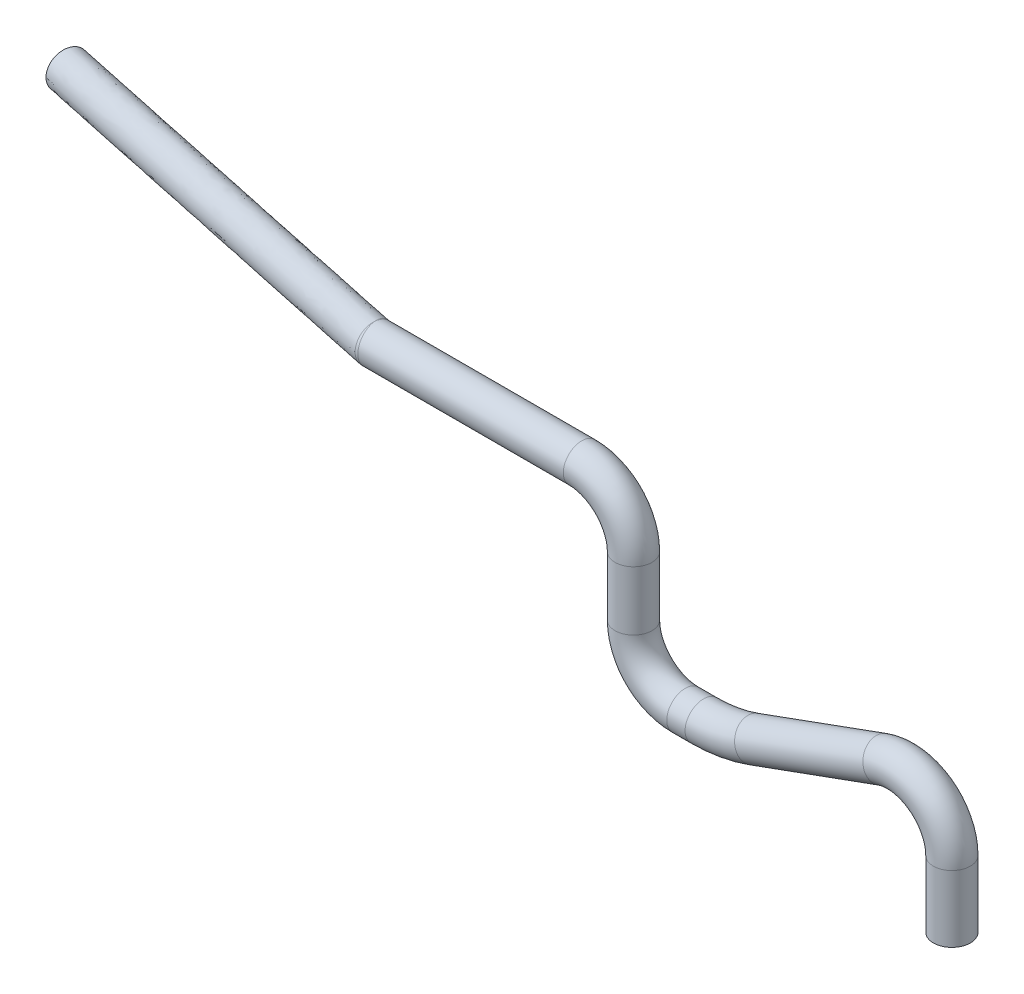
ISO-10303-21;
HEADER;
FILE_DESCRIPTION(('STEP AP214'),'2;1');
FILE_NAME('part.step','',(''),(''),'','','');
FILE_SCHEMA(('AUTOMOTIVE_DESIGN { 1 0 10303 214 1 1 1 1 }'));
ENDSEC;
DATA;
#1=APPLICATION_CONTEXT('core data for automotive mechanical design processes');
#2=APPLICATION_PROTOCOL_DEFINITION('international standard','automotive_design',2000,#1);
#3=PRODUCT_CONTEXT('',#1,'mechanical');
#4=PRODUCT('Part','Part','',(#3));
#5=PRODUCT_RELATED_PRODUCT_CATEGORY('part','',(#4));
#6=PRODUCT_DEFINITION_FORMATION('','',#4);
#7=PRODUCT_DEFINITION_CONTEXT('part definition',#1,'design');
#8=PRODUCT_DEFINITION('design','',#6,#7);
#9=PRODUCT_DEFINITION_SHAPE('','',#8);
#10=(LENGTH_UNIT() NAMED_UNIT(*) SI_UNIT(.MILLI.,.METRE.));
#11=(NAMED_UNIT(*) PLANE_ANGLE_UNIT() SI_UNIT($,.RADIAN.));
#12=(NAMED_UNIT(*) SI_UNIT($,.STERADIAN.) SOLID_ANGLE_UNIT());
#13=UNCERTAINTY_MEASURE_WITH_UNIT(LENGTH_MEASURE(1.E-05),#10,'distance_accuracy_value','');
#14=(GEOMETRIC_REPRESENTATION_CONTEXT(3) GLOBAL_UNCERTAINTY_ASSIGNED_CONTEXT((#13)) GLOBAL_UNIT_ASSIGNED_CONTEXT((#10,
#11,#12)) REPRESENTATION_CONTEXT('',''));
#15=CARTESIAN_POINT('',(0.,0.,0.));
#16=DIRECTION('',(0.,0.,1.));
#17=DIRECTION('',(1.,0.,0.));
#18=AXIS2_PLACEMENT_3D('',#15,#16,#17);
#19=CARTESIAN_POINT('',(43.0701638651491,-21.0523914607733,0.));
#20=DIRECTION('',(0.,-1.,0.));
#21=DIRECTION('',(1.,0.,0.));
#22=AXIS2_PLACEMENT_3D('',#19,#20,#21);
#23=CYLINDRICAL_SURFACE('',#22,2.5);
#24=CARTESIAN_POINT('',(43.0701638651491,-21.0523914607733,0.));
#25=DIRECTION('',(0.,-1.,0.));
#26=DIRECTION('',(0.,0.,-1.));
#27=AXIS2_PLACEMENT_3D('',#24,#25,#26);
#28=CIRCLE('',#27,2.5);
#29=CARTESIAN_POINT('',(45.5701638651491,-21.0523914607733,0.));
#30=VERTEX_POINT('',#29);
#31=EDGE_CURVE('E131',#30,#30,#28,.T.);
#32=CARTESIAN_POINT('',(43.0701638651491,-30.0553554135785,0.));
#33=DIRECTION('',(0.,-1.,0.));
#34=DIRECTION('',(0.,0.,-1.));
#35=AXIS2_PLACEMENT_3D('',#32,#33,#34);
#36=CIRCLE('',#35,2.5);
#37=CARTESIAN_POINT('',(45.5701638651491,-30.0553554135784,0.));
#38=VERTEX_POINT('',#37);
#39=EDGE_CURVE('E61',#38,#38,#36,.T.);
#40=CARTESIAN_POINT('',(45.5701638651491,-21.0523914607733,0.));
#41=CARTESIAN_POINT('',(45.5701638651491,-21.1461723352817,0.));
#42=CARTESIAN_POINT('',(45.5701638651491,-21.2399532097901,0.));
#43=CARTESIAN_POINT('',(45.5701638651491,-21.4275149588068,0.));
#44=CARTESIAN_POINT('',(45.5701638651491,-21.5212958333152,0.));
#45=CARTESIAN_POINT('',(45.5701638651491,-21.708857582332,0.));
#46=CARTESIAN_POINT('',(45.5701638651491,-21.8026384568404,0.));
#47=CARTESIAN_POINT('',(45.5701638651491,-21.9902002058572,0.));
#48=CARTESIAN_POINT('',(45.5701638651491,-22.0839810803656,0.));
#49=CARTESIAN_POINT('',(45.5701638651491,-22.2715428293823,0.));
#50=CARTESIAN_POINT('',(45.5701638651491,-22.3653237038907,0.));
#51=CARTESIAN_POINT('',(45.5701638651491,-22.5528854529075,0.));
#52=CARTESIAN_POINT('',(45.5701638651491,-22.6466663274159,0.));
#53=CARTESIAN_POINT('',(45.5701638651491,-22.8342280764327,0.));
#54=CARTESIAN_POINT('',(45.5701638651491,-22.928008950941,0.));
#55=CARTESIAN_POINT('',(45.5701638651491,-23.1155706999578,0.));
#56=CARTESIAN_POINT('',(45.5701638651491,-23.2093515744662,0.));
#57=CARTESIAN_POINT('',(45.5701638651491,-23.396913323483,0.));
#58=CARTESIAN_POINT('',(45.5701638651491,-23.4906941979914,0.));
#59=CARTESIAN_POINT('',(45.5701638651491,-23.6782559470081,0.));
#60=CARTESIAN_POINT('',(45.5701638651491,-23.7720368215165,0.));
#61=CARTESIAN_POINT('',(45.5701638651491,-23.9595985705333,0.));
#62=CARTESIAN_POINT('',(45.5701638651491,-24.0533794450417,0.));
#63=CARTESIAN_POINT('',(45.5701638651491,-24.2409411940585,0.));
#64=CARTESIAN_POINT('',(45.5701638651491,-24.3347220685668,0.));
#65=CARTESIAN_POINT('',(45.5701638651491,-24.5222838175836,0.));
#66=CARTESIAN_POINT('',(45.5701638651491,-24.616064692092,0.));
#67=CARTESIAN_POINT('',(45.5701638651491,-24.8036264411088,0.));
#68=CARTESIAN_POINT('',(45.5701638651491,-24.8974073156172,0.));
#69=CARTESIAN_POINT('',(45.5701638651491,-25.0849690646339,0.));
#70=CARTESIAN_POINT('',(45.5701638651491,-25.1787499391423,0.));
#71=CARTESIAN_POINT('',(45.5701638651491,-25.3663116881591,0.));
#72=CARTESIAN_POINT('',(45.5701638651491,-25.4600925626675,0.));
#73=CARTESIAN_POINT('',(45.5701638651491,-25.6476543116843,0.));
#74=CARTESIAN_POINT('',(45.5701638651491,-25.7414351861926,0.));
#75=CARTESIAN_POINT('',(45.5701638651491,-25.9289969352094,0.));
#76=CARTESIAN_POINT('',(45.5701638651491,-26.0227778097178,0.));
#77=CARTESIAN_POINT('',(45.5701638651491,-26.2103395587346,0.));
#78=CARTESIAN_POINT('',(45.5701638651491,-26.304120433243,0.));
#79=CARTESIAN_POINT('',(45.5701638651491,-26.4916821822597,0.));
#80=CARTESIAN_POINT('',(45.5701638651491,-26.5854630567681,0.));
#81=CARTESIAN_POINT('',(45.5701638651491,-26.7730248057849,0.));
#82=CARTESIAN_POINT('',(45.5701638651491,-26.8668056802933,0.));
#83=CARTESIAN_POINT('',(45.5701638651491,-27.0543674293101,0.));
#84=CARTESIAN_POINT('',(45.5701638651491,-27.1481483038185,0.));
#85=CARTESIAN_POINT('',(45.5701638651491,-27.3357100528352,0.));
#86=CARTESIAN_POINT('',(45.5701638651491,-27.4294909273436,0.));
#87=CARTESIAN_POINT('',(45.5701638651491,-27.6170526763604,0.));
#88=CARTESIAN_POINT('',(45.5701638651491,-27.7108335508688,0.));
#89=CARTESIAN_POINT('',(45.5701638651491,-27.8983952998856,0.));
#90=CARTESIAN_POINT('',(45.5701638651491,-27.9921761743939,0.));
#91=CARTESIAN_POINT('',(45.5701638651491,-28.1797379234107,0.));
#92=CARTESIAN_POINT('',(45.5701638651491,-28.2735187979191,0.));
#93=CARTESIAN_POINT('',(45.5701638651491,-28.4610805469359,0.));
#94=CARTESIAN_POINT('',(45.5701638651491,-28.5548614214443,0.));
#95=CARTESIAN_POINT('',(45.5701638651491,-28.742423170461,0.));
#96=CARTESIAN_POINT('',(45.5701638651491,-28.8362040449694,0.));
#97=CARTESIAN_POINT('',(45.5701638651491,-29.0237657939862,0.));
#98=CARTESIAN_POINT('',(45.5701638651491,-29.1175466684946,0.));
#99=CARTESIAN_POINT('',(45.5701638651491,-29.3051084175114,0.));
#100=CARTESIAN_POINT('',(45.5701638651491,-29.3988892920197,0.));
#101=CARTESIAN_POINT('',(45.5701638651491,-29.5864510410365,0.));
#102=CARTESIAN_POINT('',(45.5701638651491,-29.6802319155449,0.));
#103=CARTESIAN_POINT('',(45.5701638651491,-29.8677936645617,0.));
#104=CARTESIAN_POINT('',(45.5701638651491,-29.9615745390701,0.));
#105=CARTESIAN_POINT('',(45.5701638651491,-30.0553554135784,0.));
#106=B_SPLINE_CURVE_WITH_KNOTS('',3,(#40,#41,#42,#43,#44,#45,#46,#47,#48,#49,#50,#51,#52,#53,
#54,#55,#56,#57,#58,#59,#60,#61,#62,#63,#64,#65,#66,#67,#68,#69,#70,#71,#72,#73,#74,#75,#76,#77,
#78,#79,#80,#81,#82,#83,#84,#85,#86,#87,#88,#89,#90,#91,#92,#93,#94,#95,#96,#97,#98,#99,#100,
#101,#102,#103,#104,#105),.UNSPECIFIED.,.F.,.F.,(4,2,2,2,2,2,2,2,2,2,2,2,2,2,2,2,2,2,2,2,2,2,2,
2,2,2,2,2,2,2,2,2,4),(0.,0.281342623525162,0.562685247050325,0.844027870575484,1.12537049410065,
1.40671311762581,1.68805574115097,1.96939836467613,2.25074098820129,2.53208361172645,
2.81342623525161,3.09476885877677,3.37611148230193,3.65745410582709,3.93879672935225,
4.22013935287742,4.50148197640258,4.78282459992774,5.0641672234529,5.34550984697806,
5.62685247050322,5.90819509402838,6.18953771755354,6.47088034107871,6.75222296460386,
7.03356558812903,7.31490821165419,7.59625083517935,7.87759345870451,8.15893608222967,
8.44027870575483,8.72162132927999,9.00296395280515),.UNSPECIFIED.);
#107=EDGE_CURVE('BSEAM28',#30,#38,#106,.T.);
#108=ORIENTED_EDGE('',*,*,#31,.T.);
#109=ORIENTED_EDGE('',*,*,#39,.F.);
#110=ORIENTED_EDGE('',*,*,#107,.T.);
#111=ORIENTED_EDGE('',*,*,#107,.F.);
#112=EDGE_LOOP('',(#108,#110,#109,#111));
#113=FACE_BOUND('',#112,.T.);
#114=ADVANCED_FACE('F28',(#113),#23,.T.);
#115=CARTESIAN_POINT('',(36.0701638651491,-21.0523914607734,0.));
#116=DIRECTION('',(0.,0.,-1.));
#117=DIRECTION('',(-1.,0.,0.));
#118=AXIS2_PLACEMENT_3D('',#115,#116,#117);
#119=TOROIDAL_SURFACE('',#118,7.00000000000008,2.5);
#120=CARTESIAN_POINT('',(33.6760228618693,-14.474543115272,0.));
#121=DIRECTION('',(0.939692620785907,0.342020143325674,0.));
#122=DIRECTION('',(0.,0.,-1.));
#123=AXIS2_PLACEMENT_3D('',#120,#121,#122);
#124=CIRCLE('',#123,2.5);
#125=CARTESIAN_POINT('',(32.8209725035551,-12.1253115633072,0.));
#126=VERTEX_POINT('',#125);
#127=EDGE_CURVE('E128',#126,#126,#124,.T.);
#128=CARTESIAN_POINT('',(36.0701638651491,-21.0523914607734,0.));
#129=DIRECTION('',(0.,0.,-1.));
#130=DIRECTION('',(-1.,0.,0.));
#131=AXIS2_PLACEMENT_3D('',#128,#129,#130);
#132=CIRCLE('',#131,9.50000000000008);
#133=EDGE_CURVE('',#126,#30,#132,.T.);
#134=ORIENTED_EDGE('',*,*,#127,.T.);
#135=ORIENTED_EDGE('',*,*,#31,.F.);
#136=ORIENTED_EDGE('',*,*,#133,.T.);
#137=ORIENTED_EDGE('',*,*,#133,.F.);
#138=EDGE_LOOP('',(#134,#136,#135,#137));
#139=FACE_BOUND('',#138,.T.);
#140=ADVANCED_FACE('F139',(#139),#119,.T.);
#141=CARTESIAN_POINT('',(16.3138632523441,-20.7938524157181,0.));
#142=DIRECTION('',(0.939692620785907,0.342020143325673,0.));
#143=DIRECTION('',(-0.342020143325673,0.939692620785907,0.));
#144=AXIS2_PLACEMENT_3D('',#141,#142,#143);
#145=CYLINDRICAL_SURFACE('',#144,2.5);
#146=CARTESIAN_POINT('',(16.3138632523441,-20.7938524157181,0.));
#147=DIRECTION('',(0.939692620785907,0.342020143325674,0.));
#148=DIRECTION('',(0.,0.,-1.));
#149=AXIS2_PLACEMENT_3D('',#146,#147,#148);
#150=CIRCLE('',#149,2.5);
#151=CARTESIAN_POINT('',(17.1689136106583,-23.1430839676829,0.));
#152=VERTEX_POINT('',#151);
#153=EDGE_CURVE('E125',#152,#152,#150,.T.);
#154=ORIENTED_EDGE('',*,*,#153,.T.);
#155=EDGE_LOOP('',(#154));
#156=FACE_BOUND('',#155,.T.);
#157=ORIENTED_EDGE('',*,*,#127,.F.);
#158=EDGE_LOOP('',(#157));
#159=FACE_BOUND('',#158,.T.);
#160=ADVANCED_FACE('F144',(#156,#159),#145,.T.);
#161=CARTESIAN_POINT('',(9.47346038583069,-2.,0.));
#162=DIRECTION('',(0.,0.,1.));
#163=DIRECTION('',(1.,0.,0.));
#164=AXIS2_PLACEMENT_3D('',#161,#162,#163);
#165=TOROIDAL_SURFACE('',#164,20.,2.5);
#166=CARTESIAN_POINT('',(9.47346038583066,-22.,0.));
#167=DIRECTION('',(1.,0.,0.));
#168=DIRECTION('',(0.,0.,-1.));
#169=AXIS2_PLACEMENT_3D('',#166,#167,#168);
#170=CIRCLE('',#169,2.5);
#171=CARTESIAN_POINT('',(9.47346038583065,-24.5,0.));
#172=VERTEX_POINT('',#171);
#173=EDGE_CURVE('E122',#172,#172,#170,.T.);
#174=CARTESIAN_POINT('',(9.47346038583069,-2.,0.));
#175=DIRECTION('',(0.,0.,1.));
#176=DIRECTION('',(1.,0.,0.));
#177=AXIS2_PLACEMENT_3D('',#174,#175,#176);
#178=CIRCLE('',#177,22.5);
#179=EDGE_CURVE('',#172,#152,#178,.T.);
#180=ORIENTED_EDGE('',*,*,#173,.T.);
#181=ORIENTED_EDGE('',*,*,#153,.F.);
#182=ORIENTED_EDGE('',*,*,#179,.T.);
#183=ORIENTED_EDGE('',*,*,#179,.F.);
#184=EDGE_LOOP('',(#180,#182,#181,#183));
#185=FACE_BOUND('',#184,.T.);
#186=ADVANCED_FACE('F150',(#185),#165,.T.);
#187=CARTESIAN_POINT('',(7.00000000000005,-22.,0.));
#188=DIRECTION('',(1.,0.,0.));
#189=DIRECTION('',(0.,0.,-1.));
#190=AXIS2_PLACEMENT_3D('',#187,#188,#189);
#191=CYLINDRICAL_SURFACE('',#190,2.5);
#192=CARTESIAN_POINT('',(7.00000000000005,-22.,0.));
#193=DIRECTION('',(1.,0.,0.));
#194=DIRECTION('',(0.,0.,-1.));
#195=AXIS2_PLACEMENT_3D('',#192,#193,#194);
#196=CIRCLE('',#195,2.5);
#197=CARTESIAN_POINT('',(7.00000000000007,-24.5,0.));
#198=VERTEX_POINT('',#197);
#199=EDGE_CURVE('E119',#198,#198,#196,.T.);
#200=ORIENTED_EDGE('',*,*,#199,.T.);
#201=EDGE_LOOP('',(#200));
#202=FACE_BOUND('',#201,.T.);
#203=ORIENTED_EDGE('',*,*,#173,.F.);
#204=EDGE_LOOP('',(#203));
#205=FACE_BOUND('',#204,.T.);
#206=ADVANCED_FACE('F154',(#202,#205),#191,.T.);
#207=CARTESIAN_POINT('',(7.,-15.,0.));
#208=DIRECTION('',(0.,0.,1.));
#209=DIRECTION('',(1.,0.,0.));
#210=AXIS2_PLACEMENT_3D('',#207,#208,#209);
#211=TOROIDAL_SURFACE('',#210,7.,2.5);
#212=CARTESIAN_POINT('',(0.,-14.9999999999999,0.));
#213=DIRECTION('',(0.,-1.,0.));
#214=DIRECTION('',(0.,0.,-1.));
#215=AXIS2_PLACEMENT_3D('',#212,#213,#214);
#216=CIRCLE('',#215,2.5);
#217=CARTESIAN_POINT('',(-2.5,-14.9999999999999,0.));
#218=VERTEX_POINT('',#217);
#219=EDGE_CURVE('E116',#218,#218,#216,.T.);
#220=CARTESIAN_POINT('',(7.,-15.,0.));
#221=DIRECTION('',(0.,0.,1.));
#222=DIRECTION('',(1.,0.,0.));
#223=AXIS2_PLACEMENT_3D('',#220,#221,#222);
#224=CIRCLE('',#223,9.5);
#225=EDGE_CURVE('',#218,#198,#224,.T.);
#226=ORIENTED_EDGE('',*,*,#219,.T.);
#227=ORIENTED_EDGE('',*,*,#199,.F.);
#228=ORIENTED_EDGE('',*,*,#225,.T.);
#229=ORIENTED_EDGE('',*,*,#225,.F.);
#230=EDGE_LOOP('',(#226,#228,#227,#229));
#231=FACE_BOUND('',#230,.T.);
#232=ADVANCED_FACE('F158',(#231),#211,.T.);
#233=CARTESIAN_POINT('',(0.,-7.00000000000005,0.));
#234=DIRECTION('',(0.,-1.,0.));
#235=DIRECTION('',(1.,0.,0.));
#236=AXIS2_PLACEMENT_3D('',#233,#234,#235);
#237=CYLINDRICAL_SURFACE('',#236,2.5);
#238=CARTESIAN_POINT('',(0.,-7.00000000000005,0.));
#239=DIRECTION('',(0.,-1.,0.));
#240=DIRECTION('',(0.,0.,-1.));
#241=AXIS2_PLACEMENT_3D('',#238,#239,#240);
#242=CIRCLE('',#241,2.5);
#243=CARTESIAN_POINT('',(2.5,-7.00000000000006,0.));
#244=VERTEX_POINT('',#243);
#245=EDGE_CURVE('E113',#244,#244,#242,.T.);
#246=ORIENTED_EDGE('',*,*,#245,.T.);
#247=EDGE_LOOP('',(#246));
#248=FACE_BOUND('',#247,.T.);
#249=ORIENTED_EDGE('',*,*,#219,.F.);
#250=EDGE_LOOP('',(#249));
#251=FACE_BOUND('',#250,.T.);
#252=ADVANCED_FACE('F162',(#248,#251),#237,.T.);
#253=CARTESIAN_POINT('',(-7.,-7.,0.));
#254=DIRECTION('',(0.,0.,-1.));
#255=DIRECTION('',(-1.,0.,0.));
#256=AXIS2_PLACEMENT_3D('',#253,#254,#255);
#257=TOROIDAL_SURFACE('',#256,7.,2.5);
#258=CARTESIAN_POINT('',(-7.00000000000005,0.,0.));
#259=DIRECTION('',(1.,0.,0.));
#260=DIRECTION('',(0.,0.,-1.));
#261=AXIS2_PLACEMENT_3D('',#258,#259,#260);
#262=CIRCLE('',#261,2.5);
#263=CARTESIAN_POINT('',(-7.00000000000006,2.5,0.));
#264=VERTEX_POINT('',#263);
#265=EDGE_CURVE('E110',#264,#264,#262,.T.);
#266=CARTESIAN_POINT('',(-7.,-7.,0.));
#267=DIRECTION('',(0.,0.,-1.));
#268=DIRECTION('',(-1.,0.,0.));
#269=AXIS2_PLACEMENT_3D('',#266,#267,#268);
#270=CIRCLE('',#269,9.5);
#271=EDGE_CURVE('',#264,#244,#270,.T.);
#272=ORIENTED_EDGE('',*,*,#265,.T.);
#273=ORIENTED_EDGE('',*,*,#245,.F.);
#274=ORIENTED_EDGE('',*,*,#271,.T.);
#275=ORIENTED_EDGE('',*,*,#271,.F.);
#276=EDGE_LOOP('',(#272,#274,#273,#275));
#277=FACE_BOUND('',#276,.T.);
#278=ADVANCED_FACE('F165',(#277),#257,.T.);
#279=CARTESIAN_POINT('',(-7.00000000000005,0.,0.));
#280=DIRECTION('',(-1.,0.,0.));
#281=DIRECTION('',(0.,0.,1.));
#282=AXIS2_PLACEMENT_3D('',#279,#280,#281);
#283=CYLINDRICAL_SURFACE('',#282,2.5);
#284=ORIENTED_EDGE('',*,*,#265,.F.);
#285=EDGE_LOOP('',(#284));
#286=FACE_BOUND('',#285,.T.);
#287=CARTESIAN_POINT('',(-34.9999999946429,2.5,-2.52030965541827E-08));
#288=CARTESIAN_POINT('',(-34.9999999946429,2.5,-2.52030965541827E-08));
#289=CARTESIAN_POINT('',(-35.,2.5,0.));
#290=CARTESIAN_POINT('',(-35.00046653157,2.50000011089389,-0.00561377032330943));
#291=CARTESIAN_POINT('',(-34.9999976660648,2.50000013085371,-0.00559173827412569));
#292=CARTESIAN_POINT('',(-34.999528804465,2.50000012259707,-0.00556968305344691));
#293=CARTESIAN_POINT('',(-35.0009331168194,2.49998185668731,-0.0112281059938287));
#294=CARTESIAN_POINT('',(-34.9999953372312,2.49998136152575,-0.0111840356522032));
#295=CARTESIAN_POINT('',(-34.9990575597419,2.49998150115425,-0.0111399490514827));
#296=CARTESIAN_POINT('',(-35.0131544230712,2.49902307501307,-0.158285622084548));
#297=CARTESIAN_POINT('',(-34.9999343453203,2.49899517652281,-0.157664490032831));
#298=CARTESIAN_POINT('',(-34.9867141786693,2.49900323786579,-0.15704288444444));
#299=CARTESIAN_POINT('',(-35.0249305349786,2.48645427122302,-0.300004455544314));
#300=CARTESIAN_POINT('',(-34.9998757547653,2.48606219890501,-0.298832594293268));
#301=CARTESIAN_POINT('',(-34.9748197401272,2.48617671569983,-0.297642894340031));
#302=CARTESIAN_POINT('',(-35.0422968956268,2.45038553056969,-0.509500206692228));
#303=CARTESIAN_POINT('',(-34.9997970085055,2.44902957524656,-0.507237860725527));
#304=CARTESIAN_POINT('',(-34.9572605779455,2.44941857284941,-0.505313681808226));
#305=CARTESIAN_POINT('',(-35.0480453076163,2.43545433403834,-0.578930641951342));
#306=CARTESIAN_POINT('',(-34.9997722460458,2.43370373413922,-0.576270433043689));
#307=CARTESIAN_POINT('',(-34.9514452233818,2.43420638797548,-0.57411017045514));
#308=CARTESIAN_POINT('',(-35.0594075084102,2.39991127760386,-0.716402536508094));
#309=CARTESIAN_POINT('',(-34.9997268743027,2.3972616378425,-0.712836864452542));
#310=CARTESIAN_POINT('',(-34.9399420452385,2.39802171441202,-0.710246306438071));
#311=CARTESIAN_POINT('',(-35.0650211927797,2.37929515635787,-0.784442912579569));
#312=CARTESIAN_POINT('',(-34.9997062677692,2.37613931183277,-0.780372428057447));
#313=CARTESIAN_POINT('',(-34.934254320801,2.37704490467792,-0.77758481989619));
#314=CARTESIAN_POINT('',(-35.0815635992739,2.30918164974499,-0.985395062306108));
#315=CARTESIAN_POINT('',(-34.9996523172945,2.30439055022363,-0.979630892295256));
#316=CARTESIAN_POINT('',(-34.9174772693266,2.30576882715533,-0.976311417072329));
#317=CARTESIAN_POINT('',(-35.0922250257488,2.25135388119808,-1.11551544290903));
#318=CARTESIAN_POINT('',(-34.9996267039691,2.24531625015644,-1.1083559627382));
#319=CARTESIAN_POINT('',(-34.906642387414,2.24705718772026,-1.10478506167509));
#320=CARTESIAN_POINT('',(-35.1124993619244,2.11486364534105,-1.36442049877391));
#321=CARTESIAN_POINT('',(-34.9995996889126,2.10640354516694,-1.35387996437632));
#322=CARTESIAN_POINT('',(-34.8859848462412,2.10883441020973,-1.35004861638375));
#323=CARTESIAN_POINT('',(-35.122112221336,2.0362001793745,-1.48320463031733));
#324=CARTESIAN_POINT('',(-34.999598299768,2.02654558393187,-1.47068524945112));
#325=CARTESIAN_POINT('',(-34.8761622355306,2.02932227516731,-1.46683796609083));
#326=CARTESIAN_POINT('',(-35.1355390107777,1.90421049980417,-1.65020672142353));
#327=CARTESIAN_POINT('',(-34.9996122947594,1.89310419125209,-1.63436722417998));
#328=CARTESIAN_POINT('',(-34.8624026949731,1.89627812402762,-1.63067336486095));
#329=CARTESIAN_POINT('',(-35.1398503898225,1.85786475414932,-1.70402689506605));
#330=CARTESIAN_POINT('',(-34.9996196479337,1.8463183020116,-1.68703310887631));
#331=CARTESIAN_POINT('',(-34.8579773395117,1.84961724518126,-1.68340851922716));
#332=CARTESIAN_POINT('',(-35.1481142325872,1.76084341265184,-1.80753710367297));
#333=CARTESIAN_POINT('',(-34.9996388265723,1.74855581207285,-1.78816127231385));
#334=CARTESIAN_POINT('',(-34.8494822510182,1.7520639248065,-1.78471673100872));
#335=CARTESIAN_POINT('',(-35.1520670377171,1.71017202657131,-1.85723106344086));
#336=CARTESIAN_POINT('',(-34.9996506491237,1.69758190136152,-1.8366263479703));
#337=CARTESIAN_POINT('',(-34.8454121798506,1.70117559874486,-1.83329374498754));
#338=CARTESIAN_POINT('',(-35.1633597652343,1.55200941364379,-1.99968199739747));
#339=CARTESIAN_POINT('',(-34.9996913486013,1.53874344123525,-1.97535517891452));
#340=CARTESIAN_POINT('',(-34.8337668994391,1.54254311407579,-1.9723858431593));
#341=CARTESIAN_POINT('',(-35.1701343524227,1.43836625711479,-2.08581242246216));
#342=CARTESIAN_POINT('',(-34.9997254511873,1.42500236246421,-2.05890425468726));
#343=CARTESIAN_POINT('',(-34.8267562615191,1.42882794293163,-2.05626629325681));
#344=CARTESIAN_POINT('',(-35.1819919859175,1.19816071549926,-2.23741350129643));
#345=CARTESIAN_POINT('',(-34.9997971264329,1.18539098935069,-2.2055912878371));
#346=CARTESIAN_POINT('',(-34.8144546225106,1.18904354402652,-2.20363380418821));
#347=CARTESIAN_POINT('',(-35.1870761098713,1.07160662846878,-2.30289731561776));
#348=CARTESIAN_POINT('',(-34.999834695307,1.05953339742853,-2.26872396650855));
#349=CARTESIAN_POINT('',(-34.8091625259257,1.06298225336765,-2.26713385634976));
#350=CARTESIAN_POINT('',(-35.1954506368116,0.809182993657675,-2.41118909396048));
#351=CARTESIAN_POINT('',(-34.9999025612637,0.799200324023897,-2.37295184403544));
#352=CARTESIAN_POINT('',(-34.8004298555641,0.802052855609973,-2.37200875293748));
#353=CARTESIAN_POINT('',(-35.1987431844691,0.673324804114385,-2.45402416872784));
#354=CARTESIAN_POINT('',(-34.999932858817,0.664751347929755,-2.41405619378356));
#355=CARTESIAN_POINT('',(-34.7969870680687,0.667195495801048,-2.41341005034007));
#356=CARTESIAN_POINT('',(-35.2026076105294,0.447148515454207,-2.50439619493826));
#357=CARTESIAN_POINT('',(-34.9999697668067,0.441242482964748,-2.46235619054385));
#358=CARTESIAN_POINT('',(-34.7929427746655,0.442922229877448,-2.462065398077));
#359=CARTESIAN_POINT('',(-35.2037342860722,0.35837722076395,-2.51911537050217));
#360=CARTESIAN_POINT('',(-34.9999809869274,0.35359716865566,-2.4764548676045));
#361=CARTESIAN_POINT('',(-34.791762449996,0.354954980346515,-2.47627248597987));
#362=CARTESIAN_POINT('',(-35.2052380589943,0.179750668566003,-2.53877187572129));
#363=CARTESIAN_POINT('',(-34.9999961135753,0.177311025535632,-2.49527930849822));
#364=CARTESIAN_POINT('',(-34.7901866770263,0.178005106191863,-2.4952417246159));
#365=CARTESIAN_POINT('',(-35.205615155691,0.0898954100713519,-2.54370919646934));
#366=CARTESIAN_POINT('',(-35.0000000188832,0.0886772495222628,-2.50000353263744));
#367=CARTESIAN_POINT('',(-34.7897912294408,0.0890224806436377,-2.50000386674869));
#368=CARTESIAN_POINT('',(-35.205614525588,-0.141692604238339,-2.54369786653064));
#369=CARTESIAN_POINT('',(-34.9999999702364,-0.139772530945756,-2.49999443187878));
#370=CARTESIAN_POINT('',(-34.7897920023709,-0.140316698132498,-2.49999390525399));
#371=CARTESIAN_POINT('',(-35.2046766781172,-0.283484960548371,-2.53141379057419));
#372=CARTESIAN_POINT('',(-34.9999901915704,-0.279629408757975,-2.48824365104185));
#373=CARTESIAN_POINT('',(-34.790775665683,-0.280732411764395,-2.48814719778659));
#374=CARTESIAN_POINT('',(-35.2009398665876,-0.562932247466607,-2.48263971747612));
#375=CARTESIAN_POINT('',(-34.9999535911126,-0.555604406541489,-2.44150226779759));
#376=CARTESIAN_POINT('',(-34.7946887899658,-0.557692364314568,-2.44105598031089));
#377=CARTESIAN_POINT('',(-35.1981387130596,-0.700582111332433,-2.44612124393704));
#378=CARTESIAN_POINT('',(-34.9999267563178,-0.691691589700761,-2.40649362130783));
#379=CARTESIAN_POINT('',(-34.7976205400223,-0.694231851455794,-2.40578394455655));
#380=CARTESIAN_POINT('',(-35.1907304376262,-0.967489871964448,-2.3500835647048));
#381=CARTESIAN_POINT('',(-34.9998633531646,-0.956153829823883,-2.31416759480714));
#382=CARTESIAN_POINT('',(-34.8053544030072,-0.959390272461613,-2.31285292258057));
#383=CARTESIAN_POINT('',(-35.1861241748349,-1.09675172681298,-2.29057530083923));
#384=CARTESIAN_POINT('',(-34.9998267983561,-1.08451377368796,-2.25687691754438));
#385=CARTESIAN_POINT('',(-34.8101556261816,-1.08801294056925,-2.255204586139));
#386=CARTESIAN_POINT('',(-35.1752036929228,-1.34316782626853,-2.15049042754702));
#387=CARTESIAN_POINT('',(-34.9997541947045,-1.32992199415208,-2.12154381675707));
#388=CARTESIAN_POINT('',(-34.8215019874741,-1.33371148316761,-2.11918117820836));
#389=CARTESIAN_POINT('',(-35.1688899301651,-1.46032529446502,-2.06991944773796));
#390=CARTESIAN_POINT('',(-34.9997181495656,-1.44696530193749,-2.04352536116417));
#391=CARTESIAN_POINT('',(-34.828046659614,-1.45079043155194,-2.0408116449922));
#392=CARTESIAN_POINT('',(-35.1546944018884,-1.67936522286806,-1.89017694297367));
#393=CARTESIAN_POINT('',(-34.9996572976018,-1.66650155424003,-1.86881601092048));
#394=CARTESIAN_POINT('',(-34.8427099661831,-1.67019012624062,-1.8655268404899));
#395=CARTESIAN_POINT('',(-35.1468118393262,-1.78123987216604,-1.79099596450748));
#396=CARTESIAN_POINT('',(-34.9996324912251,-1.768990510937,-1.77213104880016));
#397=CARTESIAN_POINT('',(-34.8508294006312,-1.77250332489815,-1.76860214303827));
#398=CARTESIAN_POINT('',(-35.1296748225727,-1.96693491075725,-1.57703067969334));
#399=CARTESIAN_POINT('',(-34.9996027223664,-1.95639937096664,-1.56277002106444));
#400=CARTESIAN_POINT('',(-34.868420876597,-1.95942761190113,-1.55896325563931));
#401=CARTESIAN_POINT('',(-35.1204200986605,-2.05075174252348,-1.4622433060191));
#402=CARTESIAN_POINT('',(-34.9995977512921,-2.04132861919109,-1.45009836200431));
#403=CARTESIAN_POINT('',(-34.8778931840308,-2.04403521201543,-1.44624596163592));
#404=CARTESIAN_POINT('',(-35.1007786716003,-2.19825714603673,-1.22028594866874));
#405=CARTESIAN_POINT('',(-34.999611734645,-2.1911973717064,-1.21181863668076));
#406=CARTESIAN_POINT('',(-34.8979358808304,-2.19323149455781,-1.20810347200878));
#407=CARTESIAN_POINT('',(-35.0903905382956,-2.26191988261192,-1.09310034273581));
#408=CARTESIAN_POINT('',(-34.9996307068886,-2.25612924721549,-1.08619057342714));
#409=CARTESIAN_POINT('',(-34.9085076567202,-2.25779448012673,-1.0826622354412));
#410=CARTESIAN_POINT('',(-35.068793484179,-2.36738118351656,-0.830066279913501));
#411=CARTESIAN_POINT('',(-34.9996909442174,-2.36389510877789,-0.825725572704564));
#412=CARTESIAN_POINT('',(-34.9304358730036,-2.36490219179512,-0.822770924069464));
#413=CARTESIAN_POINT('',(-35.0575851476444,-2.40919514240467,-0.69422399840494));
#414=CARTESIAN_POINT('',(-34.9997321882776,-2.40676231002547,-0.690879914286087));
#415=CARTESIAN_POINT('',(-34.9417917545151,-2.40746242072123,-0.688327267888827));
#416=CARTESIAN_POINT('',(-35.0388164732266,-2.45908391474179,-0.467464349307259));
#417=CARTESIAN_POINT('',(-34.9998120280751,-2.45795373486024,-0.465447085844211));
#418=CARTESIAN_POINT('',(-34.960781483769,-2.45827885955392,-0.46366117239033));
#419=CARTESIAN_POINT('',(-35.0313928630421,-2.47388358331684,-0.377948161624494));
#420=CARTESIAN_POINT('',(-34.9998462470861,-2.47315832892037,-0.37637050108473));
#421=CARTESIAN_POINT('',(-34.9682861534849,-2.47336654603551,-0.374912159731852));
#422=CARTESIAN_POINT('',(-35.0164450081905,-2.49401540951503,-0.197887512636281));
#423=CARTESIAN_POINT('',(-34.9999179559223,-2.4938451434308,-0.19711148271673));
#424=CARTESIAN_POINT('',(-34.9833904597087,-2.49389432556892,-0.196331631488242));
#425=CARTESIAN_POINT('',(-35.0089208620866,-2.49935623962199,-0.107344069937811));
#426=CARTESIAN_POINT('',(-34.9999554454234,-2.49933801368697,-0.106922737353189));
#427=CARTESIAN_POINT('',(-34.9909900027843,-2.49934325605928,-0.106501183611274));
#428=CARTESIAN_POINT('',(-35.0009331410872,-2.49998179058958,-0.0112283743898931));
#429=CARTESIAN_POINT('',(-34.9999953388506,-2.49998128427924,-0.0111843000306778));
#430=CARTESIAN_POINT('',(-34.9990575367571,-2.49998142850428,-0.0111402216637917));
#431=CARTESIAN_POINT('',(-35.0004665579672,-2.50000004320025,-0.00561403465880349));
#432=CARTESIAN_POINT('',(-34.9999976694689,-2.50000005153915,-0.0055919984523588));
#433=CARTESIAN_POINT('',(-34.9995287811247,-2.50000004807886,-0.00556995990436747));
#434=CARTESIAN_POINT('',(-35.,-2.5,1.47451495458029E-13));
#435=CARTESIAN_POINT('',(-35.,-2.5,1.47451495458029E-13));
#436=CARTESIAN_POINT('',(-35.,-2.5,0.));
#437=(BOUNDED_SURFACE() B_SPLINE_SURFACE(3,2,((#287,#288,#289),(#290,#291,#292),(#293,#294,
#295),(#296,#297,#298),(#299,#300,#301),(#302,#303,#304),(#305,#306,#307),(#308,#309,#310),
(#311,#312,#313),(#314,#315,#316),(#317,#318,#319),(#320,#321,#322),(#323,#324,#325),(#326,#327,
#328),(#329,#330,#331),(#332,#333,#334),(#335,#336,#337),(#338,#339,#340),(#341,#342,#343),
(#344,#345,#346),(#347,#348,#349),(#350,#351,#352),(#353,#354,#355),(#356,#357,#358),(#359,#360,
#361),(#362,#363,#364),(#365,#366,#367),(#368,#369,#370),(#371,#372,#373),(#374,#375,#376),
(#377,#378,#379),(#380,#381,#382),(#383,#384,#385),(#386,#387,#388),(#389,#390,#391),(#392,#393,
#394),(#395,#396,#397),(#398,#399,#400),(#401,#402,#403),(#404,#405,#406),(#407,#408,#409),
(#410,#411,#412),(#413,#414,#415),(#416,#417,#418),(#419,#420,#421),(#422,#423,#424),(#425,#426,
#427),(#428,#429,#430),(#431,#432,#433),(#434,#435,#436)),.UNSPECIFIED.,.F.,.F.,
.F.) B_SPLINE_SURFACE_WITH_KNOTS((4,2,2,2,2,2,2,2,2,2,2,2,2,2,2,2,2,2,2,2,2,2,2,2,4),(3,3),(0.,
0.0301125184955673,0.788682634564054,1.16922859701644,1.5500605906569,2.30969489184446,
3.06936560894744,3.44944001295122,3.82914865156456,4.58853629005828,5.34743889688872,
6.10543102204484,6.58578083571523,7.06613108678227,7.82325626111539,8.58127266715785,
9.33892874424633,10.0963825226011,10.8542221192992,11.6122108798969,12.3711673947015,
13.1295884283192,13.6154233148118,14.1008125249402,14.1309250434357),(0.,1.),
.UNSPECIFIED.) GEOMETRIC_REPRESENTATION_ITEM() RATIONAL_B_SPLINE_SURFACE(((1.,1.,1.),(1.,
1.00000000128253,1.),(1.,0.999999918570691,1.),(1.,0.999995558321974,1.),(1.,0.999938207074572,
1.),(1.,0.999777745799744,1.),(1.,0.999711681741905,1.),(1.,0.99955670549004,1.),(1.,
0.999467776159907,1.),(1.,0.999170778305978,1.),(1.,0.998932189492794,1.),(1.,0.998401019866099,
1.),(1.,0.998108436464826,1.),(1.,0.997654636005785,1.),(1.,0.997500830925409,1.),(1.,
0.997192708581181,1.),(1.,0.997038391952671,1.),(1.,0.996580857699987,1.),(1.,0.996283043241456,
1.),(1.,0.995736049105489,1.),(1.,0.995486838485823,1.),(1.,0.995064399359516,1.),(1.,
0.994891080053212,1.),(1.,0.994685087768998,1.),(1.,0.9946241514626,1.),(1.,0.994542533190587,
1.),(1.,0.994521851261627,1.),(1.,0.994521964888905,1.),(1.,0.994573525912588,1.),(1.,
0.994774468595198,1.),(1.,0.994923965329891,1.),(1.,0.995304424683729,1.),(1.,0.995535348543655,
1.),(1.,0.99605327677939,1.),(1.,0.9963402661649,1.),(1.,0.996938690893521,1.),(1.,
0.997250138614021,1.),(1.,0.99786243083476,1.),(1.,0.998163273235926,1.),(1.,0.998720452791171,
1.),(1.,0.99897673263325,1.),(1.,0.999414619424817,1.),(1.,0.999596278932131,1.),(1.,
0.99981608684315,1.),(1.,0.999882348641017,1.),(1.,0.999972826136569,1.),(1.,0.999997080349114,
1.),(1.,0.999999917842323,1.),(1.,1.00000000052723,1.),(1.,1.,1.))) REPRESENTATION_ITEM('') SURFACE());
#438=CARTESIAN_POINT('',(-35.,-2.5,0.));
#439=CARTESIAN_POINT('',(-34.9995287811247,-2.50000004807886,-0.00556995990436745));
#440=CARTESIAN_POINT('',(-34.9990575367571,-2.49998142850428,-0.0111402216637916));
#441=CARTESIAN_POINT('',(-34.9909900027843,-2.49934325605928,-0.106501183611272));
#442=CARTESIAN_POINT('',(-34.9833904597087,-2.49389432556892,-0.196331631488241));
#443=CARTESIAN_POINT('',(-34.9682861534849,-2.47336654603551,-0.374912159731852));
#444=CARTESIAN_POINT('',(-34.960781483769,-2.45827885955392,-0.46366117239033));
#445=CARTESIAN_POINT('',(-34.9417917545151,-2.40746242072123,-0.688327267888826));
#446=CARTESIAN_POINT('',(-34.9304358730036,-2.36490219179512,-0.822770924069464));
#447=CARTESIAN_POINT('',(-34.9085076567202,-2.25779448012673,-1.0826622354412));
#448=CARTESIAN_POINT('',(-34.8979358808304,-2.19323149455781,-1.20810347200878));
#449=CARTESIAN_POINT('',(-34.8778931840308,-2.04403521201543,-1.44624596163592));
#450=CARTESIAN_POINT('',(-34.868420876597,-1.95942761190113,-1.55896325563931));
#451=CARTESIAN_POINT('',(-34.8508294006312,-1.77250332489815,-1.76860214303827));
#452=CARTESIAN_POINT('',(-34.8427099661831,-1.67019012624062,-1.8655268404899));
#453=CARTESIAN_POINT('',(-34.828046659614,-1.45079043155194,-2.0408116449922));
#454=CARTESIAN_POINT('',(-34.8215019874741,-1.33371148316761,-2.11918117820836));
#455=CARTESIAN_POINT('',(-34.8101556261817,-1.08801294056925,-2.255204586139));
#456=CARTESIAN_POINT('',(-34.8053544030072,-0.959390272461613,-2.31285292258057));
#457=CARTESIAN_POINT('',(-34.7976205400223,-0.694231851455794,-2.40578394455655));
#458=CARTESIAN_POINT('',(-34.7946887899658,-0.557692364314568,-2.44105598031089));
#459=CARTESIAN_POINT('',(-34.790775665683,-0.280732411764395,-2.48814719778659));
#460=CARTESIAN_POINT('',(-34.7897920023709,-0.140316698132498,-2.49999390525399));
#461=CARTESIAN_POINT('',(-34.7897912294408,0.0890224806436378,-2.50000386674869));
#462=CARTESIAN_POINT('',(-34.7901866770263,0.178005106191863,-2.4952417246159));
#463=CARTESIAN_POINT('',(-34.791762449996,0.354954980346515,-2.47627248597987));
#464=CARTESIAN_POINT('',(-34.7929427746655,0.442922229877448,-2.462065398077));
#465=CARTESIAN_POINT('',(-34.7969870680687,0.667195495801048,-2.41341005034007));
#466=CARTESIAN_POINT('',(-34.8004298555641,0.802052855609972,-2.37200875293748));
#467=CARTESIAN_POINT('',(-34.8091625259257,1.06298225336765,-2.26713385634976));
#468=CARTESIAN_POINT('',(-34.8144546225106,1.18904354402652,-2.20363380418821));
#469=CARTESIAN_POINT('',(-34.8267562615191,1.42882794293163,-2.05626629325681));
#470=CARTESIAN_POINT('',(-34.8337668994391,1.54254311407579,-1.9723858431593));
#471=CARTESIAN_POINT('',(-34.8454121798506,1.70117559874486,-1.83329374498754));
#472=CARTESIAN_POINT('',(-34.8494822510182,1.7520639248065,-1.78471673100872));
#473=CARTESIAN_POINT('',(-34.8579773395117,1.84961724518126,-1.68340851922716));
#474=CARTESIAN_POINT('',(-34.8624026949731,1.89627812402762,-1.63067336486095));
#475=CARTESIAN_POINT('',(-34.8761622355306,2.02932227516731,-1.46683796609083));
#476=CARTESIAN_POINT('',(-34.8859848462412,2.10883441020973,-1.35004861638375));
#477=CARTESIAN_POINT('',(-34.906642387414,2.24705718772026,-1.10478506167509));
#478=CARTESIAN_POINT('',(-34.9174772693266,2.30576882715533,-0.976311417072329));
#479=CARTESIAN_POINT('',(-34.934254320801,2.37704490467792,-0.77758481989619));
#480=CARTESIAN_POINT('',(-34.9399420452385,2.39802171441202,-0.710246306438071));
#481=CARTESIAN_POINT('',(-34.9514452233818,2.43420638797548,-0.57411017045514));
#482=CARTESIAN_POINT('',(-34.9572605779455,2.44941857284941,-0.505313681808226));
#483=CARTESIAN_POINT('',(-34.9748197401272,2.48617671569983,-0.297642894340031));
#484=CARTESIAN_POINT('',(-34.9867141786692,2.49900323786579,-0.157042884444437));
#485=CARTESIAN_POINT('',(-34.9990575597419,2.49998150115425,-0.0111399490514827));
#486=CARTESIAN_POINT('',(-34.999528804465,2.50000012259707,-0.0055696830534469));
#487=CARTESIAN_POINT('',(-35.,2.5,0.));
#488=B_SPLINE_CURVE_WITH_KNOTS('',3,(#438,#439,#440,#441,#442,#443,#444,#445,#446,#447,#448,
#449,#450,#451,#452,#453,#454,#455,#456,#457,#458,#459,#460,#461,#462,#463,#464,#465,#466,#467,
#468,#469,#470,#471,#472,#473,#474,#475,#476,#477,#478,#479,#480,#481,#482,#483,#484,#485,#486,
#487),.UNSPECIFIED.,.F.,.F.,(4,2,2,2,2,2,2,2,2,2,2,2,2,2,2,2,2,2,2,2,2,2,2,2,4),(0.,
0.0301125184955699,0.51550172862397,1.00133661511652,1.75975764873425,2.51871416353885,
3.27670292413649,4.03454252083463,4.7919962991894,5.54965237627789,6.30766878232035,
7.06479395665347,7.54514420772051,8.0254940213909,8.78348614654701,9.54238875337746,
10.3017763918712,10.6814850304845,11.0615594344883,11.8212301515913,12.5808644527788,
12.9616964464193,13.3422424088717,14.1008125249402,14.1309250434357),.UNSPECIFIED.);
#489=CARTESIAN_POINT('',(-35.,-2.5,0.));
#490=VERTEX_POINT('',#489);
#491=CARTESIAN_POINT('',(-35.,2.5,0.));
#492=VERTEX_POINT('',#491);
#493=EDGE_CURVE('E53',#490,#492,#488,.T.);
#494=ORIENTED_EDGE('',*,*,#493,.T.);
#495=CARTESIAN_POINT('',(-34.9999999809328,2.5,-8.97040289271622E-08));
#496=CARTESIAN_POINT('',(-34.9999999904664,2.5,-4.48520144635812E-08));
#497=CARTESIAN_POINT('',(-35.,2.5,0.));
#498=CARTESIAN_POINT('',(-35.0018303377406,2.50000286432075,0.0201169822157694));
#499=CARTESIAN_POINT('',(-35.0000868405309,2.50000143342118,0.0193385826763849));
#500=CARTESIAN_POINT('',(-34.9983433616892,2.50000049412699,0.0185602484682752));
#501=CARTESIAN_POINT('',(-35.0036609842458,2.49974997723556,0.0402379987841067));
#502=CARTESIAN_POINT('',(-35.0001736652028,2.49977711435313,0.0386814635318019));
#503=CARTESIAN_POINT('',(-34.9966863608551,2.49979370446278,0.037124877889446));
#504=CARTESIAN_POINT('',(-35.0204399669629,2.4951004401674,0.224693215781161));
#505=CARTESIAN_POINT('',(-35.0009677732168,2.49565600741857,0.216028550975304));
#506=CARTESIAN_POINT('',(-34.9814946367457,2.49599720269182,0.20734921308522));
#507=CARTESIAN_POINT('',(-35.0353415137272,2.4739940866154,0.388756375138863));
#508=CARTESIAN_POINT('',(-35.0016607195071,2.47695775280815,0.373957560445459));
#509=CARTESIAN_POINT('',(-34.9679713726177,2.47878311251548,0.359023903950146));
#510=CARTESIAN_POINT('',(-35.0639952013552,2.39945108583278,0.707954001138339));
#511=CARTESIAN_POINT('',(-35.0028065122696,2.41007685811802,0.683674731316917));
#512=CARTESIAN_POINT('',(-34.9414987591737,2.41663494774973,0.65826775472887));
#513=CARTESIAN_POINT('',(-35.0777442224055,2.34592971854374,0.863063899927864));
#514=CARTESIAN_POINT('',(-35.0032588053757,2.36179535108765,0.835490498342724));
#515=CARTESIAN_POINT('',(-34.9285510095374,2.37162822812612,0.805825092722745));
#516=CARTESIAN_POINT('',(-35.1032870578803,2.21076593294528,1.15673885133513));
#517=CARTESIAN_POINT('',(-35.0038242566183,2.23766860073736,1.12660929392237));
#518=CARTESIAN_POINT('',(-34.9038113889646,2.25444410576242,1.09139806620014));
#519=CARTESIAN_POINT('',(-35.115090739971,2.12927233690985,1.29538633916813));
#520=CARTESIAN_POINT('',(-35.0039390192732,2.16194173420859,1.26599064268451));
#521=CARTESIAN_POINT('',(-34.8920138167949,2.18241031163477,1.22945964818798));
#522=CARTESIAN_POINT('',(-35.1364995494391,1.94288592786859,1.55243397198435));
#523=CARTESIAN_POINT('',(-35.003870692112,1.9854011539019,1.52812545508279));
#524=CARTESIAN_POINT('',(-34.8699348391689,2.0122455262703,1.49172804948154));
#525=CARTESIAN_POINT('',(-35.1461072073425,1.83802032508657,1.67085738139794));
#526=CARTESIAN_POINT('',(-35.0036877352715,1.88459680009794,1.650889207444));
#527=CARTESIAN_POINT('',(-34.8596516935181,1.91414485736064,1.61595073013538));
#528=CARTESIAN_POINT('',(-35.1624441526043,1.61832578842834,1.87656374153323));
#529=CARTESIAN_POINT('',(-35.0031627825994,1.66964868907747,1.86700966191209));
#530=CARTESIAN_POINT('',(-34.8416462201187,1.70244971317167,1.83664064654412));
#531=CARTESIAN_POINT('',(-35.1693364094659,1.50485443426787,1.96552663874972));
#532=CARTESIAN_POINT('',(-35.0028337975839,1.5570854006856,1.9618757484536));
#533=CARTESIAN_POINT('',(-34.8337888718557,1.59059313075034,1.93449795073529));
#534=CARTESIAN_POINT('',(-35.1812740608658,1.26557982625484,2.1222431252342));
#535=CARTESIAN_POINT('',(-35.0021349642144,1.31648127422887,2.13071948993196));
#536=CARTESIAN_POINT('',(-34.8198697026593,1.34935210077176,2.10984649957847));
#537=CARTESIAN_POINT('',(-35.1863193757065,1.13977604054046,2.18999579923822));
#538=CARTESIAN_POINT('',(-35.0017651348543,1.18844616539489,2.20467486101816));
#539=CARTESIAN_POINT('',(-34.8138079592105,1.21996689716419,2.1873368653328));
#540=CARTESIAN_POINT('',(-35.1943059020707,0.890015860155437,2.298571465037));
#541=CARTESIAN_POINT('',(-35.001114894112,0.931689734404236,2.32405515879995));
#542=CARTESIAN_POINT('',(-34.8040583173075,0.958809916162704,2.31300463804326));
#543=CARTESIAN_POINT('',(-35.1973838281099,0.766726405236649,2.34112360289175));
#544=CARTESIAN_POINT('',(-35.0008297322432,0.803862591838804,2.37128448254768));
#545=CARTESIAN_POINT('',(-34.8002185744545,0.828069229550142,2.36303996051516));
#546=CARTESIAN_POINT('',(-35.2020962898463,0.515734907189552,2.40669572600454));
#547=CARTESIAN_POINT('',(-35.0003724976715,0.542097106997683,2.44434127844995));
#548=CARTESIAN_POINT('',(-34.7942910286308,0.559341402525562,2.44061407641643));
#549=CARTESIAN_POINT('',(-35.2037343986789,0.388044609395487,2.42976405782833));
#550=CARTESIAN_POINT('',(-35.0002002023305,0.408190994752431,2.47021183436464));
#551=CARTESIAN_POINT('',(-34.792198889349,0.421373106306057,2.46820854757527));
#552=CARTESIAN_POINT('',(-35.2049863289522,0.21647995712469,2.44741768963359));
#553=CARTESIAN_POINT('',(-35.0000673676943,0.227846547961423,2.49002667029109));
#554=CARTESIAN_POINT('',(-34.7905972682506,0.235284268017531,2.48935218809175));
#555=CARTESIAN_POINT('',(-35.2052220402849,0.173250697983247,2.45074496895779));
#556=CARTESIAN_POINT('',(-35.0000421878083,0.182368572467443,2.49376360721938));
#557=CARTESIAN_POINT('',(-34.7902953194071,0.188335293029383,2.49334112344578));
#558=CARTESIAN_POINT('',(-35.2055363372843,0.0866876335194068,2.45518427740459));
#559=CARTESIAN_POINT('',(-35.0000084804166,0.0912670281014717,2.4987512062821));
#560=CARTESIAN_POINT('',(-34.7898923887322,0.0942647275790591,2.49866621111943));
#561=CARTESIAN_POINT('',(-35.205614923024,0.0433538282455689,2.45629630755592));
#562=CARTESIAN_POINT('',(-34.9999999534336,0.0456441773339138,2.50000179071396));
#563=CARTESIAN_POINT('',(-34.7897914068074,0.047143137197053,2.50000236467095));
#564=CARTESIAN_POINT('',(-35.2056148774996,-0.122223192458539,2.45629208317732));
#565=CARTESIAN_POINT('',(-35.0000001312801,-0.128680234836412,2.49999495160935));
#566=CARTESIAN_POINT('',(-34.7897918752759,-0.132906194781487,2.4999933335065));
#567=CARTESIAN_POINT('',(-35.2049901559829,-0.244605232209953,2.44744184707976));
#568=CARTESIAN_POINT('',(-35.0000684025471,-0.257518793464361,2.49003640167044));
#569=CARTESIAN_POINT('',(-34.7905957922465,-0.265983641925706,2.4893482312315));
#570=CARTESIAN_POINT('',(-35.2024771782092,-0.48719575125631,2.41210513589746));
#571=CARTESIAN_POINT('',(-35.0003302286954,-0.512145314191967,2.45043384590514));
#572=CARTESIAN_POINT('',(-34.7937993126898,-0.528457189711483,2.44713472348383));
#573=CARTESIAN_POINT('',(-35.2005863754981,-0.607399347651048,2.38558311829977));
#574=CARTESIAN_POINT('',(-35.000524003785,-0.637911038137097,2.4207551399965));
#575=CARTESIAN_POINT('',(-34.7962021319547,-0.6578453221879,2.41552415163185));
#576=CARTESIAN_POINT('',(-35.1955104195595,-0.842922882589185,2.31525949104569));
#577=CARTESIAN_POINT('',(-35.0010015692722,-0.882885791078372,2.34259612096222));
#578=CARTESIAN_POINT('',(-34.8025514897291,-0.908901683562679,2.33266538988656));
#579=CARTESIAN_POINT('',(-35.1923276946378,-0.958251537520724,2.27149030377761));
#580=CARTESIAN_POINT('',(-35.0012851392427,-1.00209340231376,2.29416050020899));
#581=CARTESIAN_POINT('',(-34.8064951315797,-1.03058390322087,2.28145405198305));
#582=CARTESIAN_POINT('',(-35.1846210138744,-1.18186325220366,2.16722608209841));
#583=CARTESIAN_POINT('',(-35.0018878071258,-1.23128123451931,2.17983769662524));
#584=CARTESIAN_POINT('',(-34.8158439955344,-1.26324311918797,2.16133308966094));
#585=CARTESIAN_POINT('',(-35.1800975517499,-1.29014888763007,2.10673720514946));
#586=CARTESIAN_POINT('',(-35.0022068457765,-1.3412555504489,2.1139695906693));
#587=CARTESIAN_POINT('',(-34.8212486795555,-1.37422403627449,2.09242998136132));
#588=CARTESIAN_POINT('',(-35.1695242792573,-1.49999090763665,1.96806025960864));
#589=CARTESIAN_POINT('',(-35.0028195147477,-1.55213374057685,1.96464385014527));
#590=CARTESIAN_POINT('',(-34.8335618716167,-1.58557735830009,1.93740700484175));
#591=CARTESIAN_POINT('',(-35.1634391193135,-1.60131121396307,1.889467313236));
#592=CARTESIAN_POINT('',(-35.0031123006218,-1.6527388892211,1.88080145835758));
#593=CARTESIAN_POINT('',(-34.8405046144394,-1.6856149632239,1.85089959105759));
#594=CARTESIAN_POINT('',(-35.1497611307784,-1.79159393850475,1.71658767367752));
#595=CARTESIAN_POINT('',(-35.0035840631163,-1.83938525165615,1.69874351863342));
#596=CARTESIAN_POINT('',(-34.8556579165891,-1.86973735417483,1.66470418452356));
#597=CARTESIAN_POINT('',(-35.1421678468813,-1.88055261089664,1.62229624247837));
#598=CARTESIAN_POINT('',(-35.0037630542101,-1.92542455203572,1.60053700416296));
#599=CARTESIAN_POINT('',(-34.8638688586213,-1.95381730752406,1.56501221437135));
#600=CARTESIAN_POINT('',(-35.1249698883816,-2.04848461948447,1.41328845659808));
#601=CARTESIAN_POINT('',(-35.0039428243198,-2.08582032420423,1.38574509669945));
#602=CARTESIAN_POINT('',(-34.8819122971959,-2.1092871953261,1.3489619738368));
#603=CARTESIAN_POINT('',(-35.115269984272,-2.12650255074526,1.29767056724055));
#604=CARTESIAN_POINT('',(-35.003932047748,-2.15914147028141,1.26840413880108));
#605=CARTESIAN_POINT('',(-34.8918136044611,-2.17957335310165,1.23195477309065));
#606=CARTESIAN_POINT('',(-35.0943219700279,-2.26243863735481,1.05302358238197));
#607=CARTESIAN_POINT('',(-35.0036576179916,-2.28539587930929,1.02335896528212));
#608=CARTESIAN_POINT('',(-34.9125736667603,-2.29967811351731,0.989825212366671));
#609=CARTESIAN_POINT('',(-35.0830733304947,-2.32034989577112,0.923989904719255));
#610=CARTESIAN_POINT('',(-35.0033940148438,-2.33833918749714,0.895647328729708));
#611=CARTESIAN_POINT('',(-34.9234327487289,-2.3494896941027,0.864700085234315));
#612=CARTESIAN_POINT('',(-35.0609159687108,-2.40715419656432,0.673607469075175));
#613=CARTESIAN_POINT('',(-35.0026855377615,-2.41704416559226,0.65031038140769));
#614=CARTESIAN_POINT('',(-34.9443489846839,-2.42314711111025,0.626014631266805));
#615=CARTESIAN_POINT('',(-35.0501509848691,-2.43882907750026,0.553418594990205));
#616=CARTESIAN_POINT('',(-35.0022685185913,-2.44544374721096,0.533504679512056));
#617=CARTESIAN_POINT('',(-34.9543285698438,-2.4495156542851,0.513047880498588));
#618=CARTESIAN_POINT('',(-35.0280968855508,-2.48329185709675,0.308997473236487));
#619=CARTESIAN_POINT('',(-35.0013236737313,-2.48517840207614,0.297180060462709));
#620=CARTESIAN_POINT('',(-34.9745455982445,-2.4863381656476,0.285292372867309));
#621=CARTESIAN_POINT('',(-35.0168087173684,-2.49611261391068,0.184772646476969));
#622=CARTESIAN_POINT('',(-35.0007959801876,-2.49655085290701,0.177644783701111));
#623=CARTESIAN_POINT('',(-34.9847825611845,-2.49681982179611,0.17050713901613));
#624=CARTESIAN_POINT('',(-35.0036610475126,-2.49974899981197,0.0402389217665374));
#625=CARTESIAN_POINT('',(-35.000173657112,-2.49977662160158,0.0386824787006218));
#626=CARTESIAN_POINT('',(-34.996686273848,-2.4997935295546,0.0371259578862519));
#627=CARTESIAN_POINT('',(-35.0018304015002,-2.50000179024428,0.0201179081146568));
#628=CARTESIAN_POINT('',(-35.0000868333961,-2.50000090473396,0.0193396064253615));
#629=CARTESIAN_POINT('',(-34.9983432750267,-2.50000032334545,0.0185613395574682));
#630=CARTESIAN_POINT('',(-35.000000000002,-2.5,9.62424584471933E-12));
#631=CARTESIAN_POINT('',(-35.000000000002,-2.5,9.62424584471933E-12));
#632=CARTESIAN_POINT('',(-35.,-2.5,0.));
#633=(BOUNDED_SURFACE() B_SPLINE_SURFACE(3,2,((#495,#496,#497),(#498,#499,#500),(#501,#502,
#503),(#504,#505,#506),(#507,#508,#509),(#510,#511,#512),(#513,#514,#515),(#516,#517,#518),
(#519,#520,#521),(#522,#523,#524),(#525,#526,#527),(#528,#529,#530),(#531,#532,#533),(#534,#535,
#536),(#537,#538,#539),(#540,#541,#542),(#543,#544,#545),(#546,#547,#548),(#549,#550,#551),
(#552,#553,#554),(#555,#556,#557),(#558,#559,#560),(#561,#562,#563),(#564,#565,#566),(#567,#568,
#569),(#570,#571,#572),(#573,#574,#575),(#576,#577,#578),(#579,#580,#581),(#582,#583,#584),
(#585,#586,#587),(#588,#589,#590),(#591,#592,#593),(#594,#595,#596),(#597,#598,#599),(#600,#601,
#602),(#603,#604,#605),(#606,#607,#608),(#609,#610,#611),(#612,#613,#614),(#615,#616,#617),
(#618,#619,#620),(#621,#622,#623),(#624,#625,#626),(#627,#628,#629),(#630,#631,#632)),
.UNSPECIFIED.,.F.,.F.,.F.) B_SPLINE_SURFACE_WITH_KNOTS((4,2,2,2,2,2,2,2,2,2,2,2,2,2,2,2,2,2,2,2,
2,2,4),(3,3),(0.,0.0121973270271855,0.111839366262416,0.21174296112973,0.311123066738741,
0.410388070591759,0.502129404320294,0.593874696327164,0.678232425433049,0.76238021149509,
0.79065314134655,0.818926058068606,0.898633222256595,0.97850118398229,1.05821971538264,
1.13790892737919,1.21959147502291,1.30129872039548,1.38804985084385,1.47483070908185,
1.55040332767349,1.62584408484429,1.63804141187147),(0.,1.),
.UNSPECIFIED.) GEOMETRIC_REPRESENTATION_ITEM() RATIONAL_B_SPLINE_SURFACE(((1.,1.,1.),(1.,
1.00000004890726,1.),(1.,0.999998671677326,1.),(1.,0.999973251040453,1.),(1.,0.99985749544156,
1.),(1.,0.999473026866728,1.),(1.,0.999203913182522,1.),(1.,0.998585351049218,1.),(1.,
0.998236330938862,1.),(1.,0.997528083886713,1.),(1.,0.997168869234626,1.),(1.,0.996517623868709,
1.),(1.,0.996222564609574,1.),(1.,0.995692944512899,1.),(1.,0.995458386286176,1.),(1.,
0.995079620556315,1.),(1.,0.994929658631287,1.),(1.,0.994697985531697,1.),(1.,0.994616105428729,
1.),(1.,0.994553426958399,1.),(1.,0.994541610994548,1.),(1.,0.994525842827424,1.),(1.,
0.994521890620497,1.),(1.,0.994521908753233,1.),(1.,0.994553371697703,1.),(1.,0.994678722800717,
1.),(1.,0.994772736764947,1.),(1.,0.995020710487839,1.),(1.,0.995174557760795,1.),(1.,
0.995537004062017,1.),(1.,0.995745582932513,1.),(1.,0.996213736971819,1.),(1.,0.996474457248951,
1.),(1.,0.997025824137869,1.),(1.,0.997316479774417,1.),(1.,0.997918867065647,1.),(1.,
0.998230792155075,1.),(1.,0.998814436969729,1.),(1.,0.999086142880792,1.),(1.,0.999511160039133,
1.),(1.,0.999675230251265,1.),(1.,0.999908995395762,1.),(1.,0.999978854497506,1.),(1.,
0.999998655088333,1.),(1.,1.00000003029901,1.),(1.,1.,1.))) REPRESENTATION_ITEM('') SURFACE());
#634=CARTESIAN_POINT('',(-35.,2.5,0.));
#635=CARTESIAN_POINT('',(-34.9983433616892,2.50000049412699,0.0185602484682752));
#636=CARTESIAN_POINT('',(-34.9966863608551,2.49979370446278,0.037124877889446));
#637=CARTESIAN_POINT('',(-34.9814946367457,2.49599720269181,0.20734921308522));
#638=CARTESIAN_POINT('',(-34.9679713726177,2.47878311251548,0.359023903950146));
#639=CARTESIAN_POINT('',(-34.9414987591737,2.41663494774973,0.65826775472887));
#640=CARTESIAN_POINT('',(-34.9285510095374,2.37162822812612,0.805825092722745));
#641=CARTESIAN_POINT('',(-34.9038113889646,2.25444410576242,1.09139806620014));
#642=CARTESIAN_POINT('',(-34.8920138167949,2.18241031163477,1.22945964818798));
#643=CARTESIAN_POINT('',(-34.8699348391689,2.0122455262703,1.49172804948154));
#644=CARTESIAN_POINT('',(-34.8596516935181,1.91414485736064,1.61595073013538));
#645=CARTESIAN_POINT('',(-34.8416462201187,1.70244971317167,1.83664064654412));
#646=CARTESIAN_POINT('',(-34.8337888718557,1.59059313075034,1.93449795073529));
#647=CARTESIAN_POINT('',(-34.8198697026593,1.34935210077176,2.10984649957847));
#648=CARTESIAN_POINT('',(-34.8138079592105,1.21996689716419,2.1873368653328));
#649=CARTESIAN_POINT('',(-34.8040583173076,0.958809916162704,2.31300463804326));
#650=CARTESIAN_POINT('',(-34.8002185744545,0.828069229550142,2.36303996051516));
#651=CARTESIAN_POINT('',(-34.7942910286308,0.559341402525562,2.44061407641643));
#652=CARTESIAN_POINT('',(-34.792198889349,0.421373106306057,2.46820854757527));
#653=CARTESIAN_POINT('',(-34.7905972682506,0.235284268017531,2.48935218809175));
#654=CARTESIAN_POINT('',(-34.7902953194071,0.188335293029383,2.49334112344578));
#655=CARTESIAN_POINT('',(-34.7898923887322,0.0942647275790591,2.49866621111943));
#656=CARTESIAN_POINT('',(-34.7897914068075,0.047143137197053,2.50000236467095));
#657=CARTESIAN_POINT('',(-34.7897918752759,-0.132906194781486,2.4999933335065));
#658=CARTESIAN_POINT('',(-34.7905957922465,-0.265983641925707,2.48934823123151));
#659=CARTESIAN_POINT('',(-34.7937993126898,-0.528457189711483,2.44713472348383));
#660=CARTESIAN_POINT('',(-34.7962021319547,-0.6578453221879,2.41552415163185));
#661=CARTESIAN_POINT('',(-34.8025514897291,-0.908901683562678,2.33266538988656));
#662=CARTESIAN_POINT('',(-34.8064951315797,-1.03058390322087,2.28145405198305));
#663=CARTESIAN_POINT('',(-34.8158439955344,-1.26324311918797,2.16133308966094));
#664=CARTESIAN_POINT('',(-34.8212486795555,-1.37422403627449,2.09242998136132));
#665=CARTESIAN_POINT('',(-34.8335618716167,-1.58557735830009,1.93740700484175));
#666=CARTESIAN_POINT('',(-34.8405046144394,-1.6856149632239,1.85089959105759));
#667=CARTESIAN_POINT('',(-34.8556579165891,-1.86973735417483,1.66470418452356));
#668=CARTESIAN_POINT('',(-34.8638688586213,-1.95381730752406,1.56501221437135));
#669=CARTESIAN_POINT('',(-34.8819122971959,-2.1092871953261,1.3489619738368));
#670=CARTESIAN_POINT('',(-34.8918136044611,-2.17957335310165,1.23195477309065));
#671=CARTESIAN_POINT('',(-34.9125736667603,-2.29967811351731,0.98982521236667));
#672=CARTESIAN_POINT('',(-34.9234327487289,-2.3494896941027,0.864700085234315));
#673=CARTESIAN_POINT('',(-34.9443489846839,-2.42314711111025,0.626014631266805));
#674=CARTESIAN_POINT('',(-34.9543285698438,-2.4495156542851,0.513047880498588));
#675=CARTESIAN_POINT('',(-34.9745455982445,-2.4863381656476,0.285292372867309));
#676=CARTESIAN_POINT('',(-34.9847825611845,-2.49681982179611,0.17050713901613));
#677=CARTESIAN_POINT('',(-34.996686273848,-2.4997935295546,0.0371259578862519));
#678=CARTESIAN_POINT('',(-34.9983432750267,-2.50000032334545,0.0185613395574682));
#679=CARTESIAN_POINT('',(-35.,-2.5,0.));
#680=B_SPLINE_CURVE_WITH_KNOTS('',3,(#634,#635,#636,#637,#638,#639,#640,#641,#642,#643,#644,
#645,#646,#647,#648,#649,#650,#651,#652,#653,#654,#655,#656,#657,#658,#659,#660,#661,#662,#663,
#664,#665,#666,#667,#668,#669,#670,#671,#672,#673,#674,#675,#676,#677,#678,#679),.UNSPECIFIED.,
.F.,.F.,(4,2,2,2,2,2,2,2,2,2,2,2,2,2,2,2,2,2,2,2,2,2,4),(0.,0.0121973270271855,
0.111839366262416,0.21174296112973,0.311123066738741,0.410388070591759,0.502129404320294,
0.593874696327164,0.678232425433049,0.76238021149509,0.79065314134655,0.818926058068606,
0.898633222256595,0.97850118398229,1.05821971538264,1.13790892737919,1.21959147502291,
1.30129872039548,1.38804985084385,1.47483070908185,1.55040332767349,1.62584408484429,
1.63804141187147),.UNSPECIFIED.);
#681=EDGE_CURVE('E57',#492,#490,#680,.T.);
#682=ORIENTED_EDGE('',*,*,#681,.T.);
#683=EDGE_LOOP('',(#494,#682));
#684=FACE_BOUND('',#683,.T.);
#685=ADVANCED_FACE('F60',(#286,#684),#283,.T.);
#686=CARTESIAN_POINT('',(43.0701638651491,-30.0553554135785,0.));
#687=DIRECTION('',(0.,-1.,0.));
#688=DIRECTION('',(0.,0.,-1.));
#689=AXIS2_PLACEMENT_3D('',#686,#687,#688);
#690=PLANE('',#689);
#691=ORIENTED_EDGE('',*,*,#39,.T.);
#692=EDGE_LOOP('',(#691));
#693=FACE_BOUND('',#692,.T.);
#694=ADVANCED_FACE('F136',(#693),#690,.T.);
#695=CARTESIAN_POINT('',(-88.7981180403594,0.,-11.4351429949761));
#696=DIRECTION('',(-1.,0.,0.));
#697=DIRECTION('',(0.,0.,1.));
#698=AXIS2_PLACEMENT_3D('',#695,#696,#697);
#699=CIRCLE('',#698,2.5);
#700=DIRECTION('',(0.978147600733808,0.,0.207911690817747));
#701=VECTOR('',#700,1.);
#702=SURFACE_OF_LINEAR_EXTRUSION('',#699,#701);
#703=CARTESIAN_POINT('',(-88.3077530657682,0.,-8.83091270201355));
#704=CARTESIAN_POINT('',(-88.3077544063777,-0.0702466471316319,-8.83090639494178));
#705=CARTESIAN_POINT('',(-88.3071523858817,-0.140447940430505,-8.83373867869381));
#706=CARTESIAN_POINT('',(-88.3035342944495,-0.350821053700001,-8.85076046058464));
#707=CARTESIAN_POINT('',(-88.2986999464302,-0.490395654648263,-8.87350427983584));
#708=CARTESIAN_POINT('',(-88.2843183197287,-0.763386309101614,-8.94116451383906));
#709=CARTESIAN_POINT('',(-88.2747818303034,-0.896815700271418,-8.98603016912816));
#710=CARTESIAN_POINT('',(-88.251329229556,-1.15318439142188,-9.09636598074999));
#711=CARTESIAN_POINT('',(-88.2374495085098,-1.27620043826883,-9.16166493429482));
#712=CARTESIAN_POINT('',(-88.2057898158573,-1.50824890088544,-9.31061207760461));
#713=CARTESIAN_POINT('',(-88.1880505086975,-1.6174096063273,-9.39406895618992));
#714=CARTESIAN_POINT('',(-88.1492530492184,-1.81892410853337,-9.57659665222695));
#715=CARTESIAN_POINT('',(-88.1282329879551,-1.91144738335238,-9.67548826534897));
#716=CARTESIAN_POINT('',(-88.0835180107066,-2.077515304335,-9.8858556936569));
#717=CARTESIAN_POINT('',(-88.0598533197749,-2.1512480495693,-9.99718931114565));
#718=CARTESIAN_POINT('',(-88.0105233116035,-2.27819182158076,-10.22926875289));
#719=CARTESIAN_POINT('',(-87.9848777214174,-2.33158002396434,-10.349921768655));
#720=CARTESIAN_POINT('',(-87.9322679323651,-2.41684573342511,-10.5974313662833));
#721=CARTESIAN_POINT('',(-87.9053133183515,-2.44885992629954,-10.7242428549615));
#722=CARTESIAN_POINT('',(-87.8507634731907,-2.49086524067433,-10.9808796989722));
#723=CARTESIAN_POINT('',(-87.8231706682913,-2.50092918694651,-11.1106936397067));
#724=CARTESIAN_POINT('',(-87.7680195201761,-2.49893573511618,-11.3701593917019));
#725=CARTESIAN_POINT('',(-87.7404611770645,-2.48687827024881,-11.4998112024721));
#726=CARTESIAN_POINT('',(-87.6861396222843,-2.44101849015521,-11.7553740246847));
#727=CARTESIAN_POINT('',(-87.659376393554,-2.40721664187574,-11.881285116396));
#728=CARTESIAN_POINT('',(-87.607372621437,-2.31891079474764,-12.1259436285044));
#729=CARTESIAN_POINT('',(-87.5821320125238,-2.26440768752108,-12.2446913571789));
#730=CARTESIAN_POINT('',(-87.5338406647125,-2.13633822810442,-12.4718842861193));
#731=CARTESIAN_POINT('',(-87.5107897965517,-2.06277300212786,-12.5803300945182));
#732=CARTESIAN_POINT('',(-87.4674644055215,-1.89871560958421,-12.7841600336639));
#733=CARTESIAN_POINT('',(-87.4471896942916,-1.808224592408,-12.8795450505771));
#734=CARTESIAN_POINT('',(-87.4099100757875,-1.61283915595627,-13.0549318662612));
#735=CARTESIAN_POINT('',(-87.3929049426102,-1.50794573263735,-13.1349347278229));
#736=CARTESIAN_POINT('',(-87.3625597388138,-1.28656063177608,-13.2776976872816));
#737=CARTESIAN_POINT('',(-87.3492194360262,-1.17006968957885,-13.3404588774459));
#738=CARTESIAN_POINT('',(-87.3265009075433,-0.928485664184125,-13.4473411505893));
#739=CARTESIAN_POINT('',(-87.3171224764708,-0.803393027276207,-13.4914631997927));
#740=CARTESIAN_POINT('',(-87.3025291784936,-0.5477211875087,-13.5601192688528));
#741=CARTESIAN_POINT('',(-87.2973141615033,-0.417142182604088,-13.5846539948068));
#742=CARTESIAN_POINT('',(-87.2911569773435,-0.153679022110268,-13.6136212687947));
#743=CARTESIAN_POINT('',(-87.2902147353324,-0.0207949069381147,-13.6180541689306));
#744=CARTESIAN_POINT('',(-87.2926225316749,0.244071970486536,-13.6067263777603));
#745=CARTESIAN_POINT('',(-87.2959725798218,0.3760547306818,-13.5909656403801));
#746=CARTESIAN_POINT('',(-87.3068950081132,0.635922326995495,-13.5395796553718));
#747=CARTESIAN_POINT('',(-87.3144674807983,0.763807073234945,-13.5039539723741));
#748=CARTESIAN_POINT('',(-87.3336738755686,1.0123292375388,-13.4135949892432));
#749=CARTESIAN_POINT('',(-87.345307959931,1.13296636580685,-13.3588609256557));
#750=CARTESIAN_POINT('',(-87.3723827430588,1.36393813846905,-13.2314840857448));
#751=CARTESIAN_POINT('',(-87.3878236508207,1.47427221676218,-13.1588403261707));
#752=CARTESIAN_POINT('',(-87.4221600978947,1.68174003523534,-12.997300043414));
#753=CARTESIAN_POINT('',(-87.4410558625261,1.77887291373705,-12.9084024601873));
#754=CARTESIAN_POINT('',(-87.4818514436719,1.95727993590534,-12.7164743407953));
#755=CARTESIAN_POINT('',(-87.5037514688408,2.03855297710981,-12.6134428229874));
#756=CARTESIAN_POINT('',(-87.5500090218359,2.18292108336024,-12.3958181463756));
#757=CARTESIAN_POINT('',(-87.5743667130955,2.24601493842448,-12.2812242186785));
#758=CARTESIAN_POINT('',(-87.6249060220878,2.35215423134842,-12.0434554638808));
#759=CARTESIAN_POINT('',(-87.6510877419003,2.39519854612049,-11.920280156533));
#760=CARTESIAN_POINT('',(-87.7045712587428,2.45992303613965,-11.6686599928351));
#761=CARTESIAN_POINT('',(-87.7318730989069,2.48160238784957,-11.5402149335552));
#762=CARTESIAN_POINT('',(-87.7868369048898,2.50291685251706,-11.2816305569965));
#763=CARTESIAN_POINT('',(-87.8144987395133,2.50255978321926,-11.1514918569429));
#764=CARTESIAN_POINT('',(-87.8694279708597,2.47983214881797,-10.8930701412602));
#765=CARTESIAN_POINT('',(-87.8966953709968,2.45746177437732,-10.7647871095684));
#766=CARTESIAN_POINT('',(-87.9500877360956,2.39140296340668,-10.5135957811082));
#767=CARTESIAN_POINT('',(-87.9762127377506,2.34771521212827,-10.3906873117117));
#768=CARTESIAN_POINT('',(-88.0266188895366,2.24035409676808,-10.1535450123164));
#769=CARTESIAN_POINT('',(-88.0509001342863,2.17668175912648,-10.0393107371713));
#770=CARTESIAN_POINT('',(-88.0969881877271,2.03123524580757,-9.82248349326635));
#771=CARTESIAN_POINT('',(-88.118795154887,1.94946223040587,-9.71988977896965));
#772=CARTESIAN_POINT('',(-88.1593913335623,1.77014412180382,-9.5288997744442));
#773=CARTESIAN_POINT('',(-88.178180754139,1.67260012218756,-9.44050250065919));
#774=CARTESIAN_POINT('',(-88.2122948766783,1.46440321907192,-9.28000817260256));
#775=CARTESIAN_POINT('',(-88.2276198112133,1.35375119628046,-9.20791002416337));
#776=CARTESIAN_POINT('',(-88.2544555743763,1.1222468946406,-9.08165768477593));
#777=CARTESIAN_POINT('',(-88.2659666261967,1.00139521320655,-9.02750244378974));
#778=CARTESIAN_POINT('',(-88.2859511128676,0.739064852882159,-8.9334828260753));
#779=CARTESIAN_POINT('',(-88.2939617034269,0.596768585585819,-8.89579596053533));
#780=CARTESIAN_POINT('',(-88.3049445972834,0.303009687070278,-8.84412550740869));
#781=CARTESIAN_POINT('',(-88.3077501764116,0.151399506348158,-8.83092629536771));
#782=CARTESIAN_POINT('',(-88.3077530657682,0.,-8.83091270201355));
#783=B_SPLINE_CURVE_WITH_KNOTS('',3,(#703,#704,#705,#706,#707,#708,#709,#710,#711,#712,#713,
#714,#715,#716,#717,#718,#719,#720,#721,#722,#723,#724,#725,#726,#727,#728,#729,#730,#731,#732,
#733,#734,#735,#736,#737,#738,#739,#740,#741,#742,#743,#744,#745,#746,#747,#748,#749,#750,#751,
#752,#753,#754,#755,#756,#757,#758,#759,#760,#761,#762,#763,#764,#765,#766,#767,#768,#769,#770,
#771,#772,#773,#774,#775,#776,#777,#778,#779,#780,#781,#782),.UNSPECIFIED.,.T.,.F.,(4,2,2,2,2,2,
2,2,2,2,2,2,2,2,2,2,2,2,2,2,2,2,2,2,2,2,2,2,2,2,2,2,2,2,2,2,2,2,2,4),(0.,0.210630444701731,
0.632981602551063,1.05436813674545,1.47231452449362,1.88605404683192,2.29530524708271,
2.70028274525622,3.10164808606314,3.50042148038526,3.89786983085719,4.29531938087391,
4.69276039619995,5.0901842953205,5.48758471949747,5.88495816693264,6.28230414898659,
6.67962495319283,7.07692515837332,7.47421104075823,7.87148996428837,8.2687697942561,
8.6660583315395,9.06336274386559,9.46068897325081,9.8580411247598,10.2554208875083,
10.6528270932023,11.0502555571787,11.4476993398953,11.8450021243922,12.2423014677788,
12.6395880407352,13.0368542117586,13.4340949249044,13.8313081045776,14.2284946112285,
14.6256578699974,15.0657519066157,15.5197144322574),.UNSPECIFIED.);
#784=CARTESIAN_POINT('',(-88.3077530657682,0.,-8.83091270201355));
#785=VERTEX_POINT('',#784);
#786=EDGE_CURVE('E33',#785,#785,#783,.T.);
#787=ORIENTED_EDGE('',*,*,#786,.T.);
#788=EDGE_LOOP('',(#787));
#789=FACE_BOUND('',#788,.T.);
#790=CARTESIAN_POINT('',(-35.000000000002,-2.5,9.62424584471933E-12));
#791=CARTESIAN_POINT('',(-35.0018304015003,-2.50000179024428,0.0201179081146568));
#792=CARTESIAN_POINT('',(-35.0036610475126,-2.49974899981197,0.0402389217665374));
#793=CARTESIAN_POINT('',(-35.0168087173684,-2.49611261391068,0.184772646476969));
#794=CARTESIAN_POINT('',(-35.0280968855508,-2.48329185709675,0.308997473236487));
#795=CARTESIAN_POINT('',(-35.0501509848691,-2.43882907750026,0.553418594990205));
#796=CARTESIAN_POINT('',(-35.0609159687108,-2.40715419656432,0.673607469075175));
#797=CARTESIAN_POINT('',(-35.0830733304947,-2.32034989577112,0.923989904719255));
#798=CARTESIAN_POINT('',(-35.0943219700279,-2.26243863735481,1.05302358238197));
#799=CARTESIAN_POINT('',(-35.115269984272,-2.12650255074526,1.29767056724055));
#800=CARTESIAN_POINT('',(-35.1249698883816,-2.04848461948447,1.41328845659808));
#801=CARTESIAN_POINT('',(-35.1421678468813,-1.88055261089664,1.62229624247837));
#802=CARTESIAN_POINT('',(-35.1497611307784,-1.79159393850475,1.71658767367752));
#803=CARTESIAN_POINT('',(-35.1634391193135,-1.60131121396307,1.889467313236));
#804=CARTESIAN_POINT('',(-35.1695242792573,-1.49999090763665,1.96806025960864));
#805=CARTESIAN_POINT('',(-35.1800975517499,-1.29014888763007,2.10673720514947));
#806=CARTESIAN_POINT('',(-35.1846210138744,-1.18186325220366,2.16722608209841));
#807=CARTESIAN_POINT('',(-35.1923276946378,-0.958251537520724,2.27149030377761));
#808=CARTESIAN_POINT('',(-35.1955104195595,-0.842922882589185,2.31525949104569));
#809=CARTESIAN_POINT('',(-35.2005863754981,-0.607399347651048,2.38558311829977));
#810=CARTESIAN_POINT('',(-35.2024771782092,-0.48719575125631,2.41210513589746));
#811=CARTESIAN_POINT('',(-35.2049901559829,-0.244605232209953,2.44744184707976));
#812=CARTESIAN_POINT('',(-35.2056148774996,-0.122223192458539,2.45629208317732));
#813=CARTESIAN_POINT('',(-35.205614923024,0.0433538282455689,2.45629630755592));
#814=CARTESIAN_POINT('',(-35.2055363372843,0.0866876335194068,2.45518427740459));
#815=CARTESIAN_POINT('',(-35.2052220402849,0.173250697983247,2.45074496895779));
#816=CARTESIAN_POINT('',(-35.2049863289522,0.21647995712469,2.44741768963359));
#817=CARTESIAN_POINT('',(-35.2037343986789,0.388044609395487,2.42976405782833));
#818=CARTESIAN_POINT('',(-35.2020962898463,0.515734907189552,2.40669572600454));
#819=CARTESIAN_POINT('',(-35.1973838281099,0.766726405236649,2.34112360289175));
#820=CARTESIAN_POINT('',(-35.1943059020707,0.890015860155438,2.298571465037));
#821=CARTESIAN_POINT('',(-35.1863193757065,1.13977604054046,2.18999579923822));
#822=CARTESIAN_POINT('',(-35.1812740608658,1.26557982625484,2.1222431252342));
#823=CARTESIAN_POINT('',(-35.1693364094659,1.50485443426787,1.96552663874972));
#824=CARTESIAN_POINT('',(-35.1624441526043,1.61832578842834,1.87656374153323));
#825=CARTESIAN_POINT('',(-35.1461072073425,1.83802032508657,1.67085738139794));
#826=CARTESIAN_POINT('',(-35.1364995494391,1.94288592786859,1.55243397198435));
#827=CARTESIAN_POINT('',(-35.115090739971,2.12927233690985,1.29538633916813));
#828=CARTESIAN_POINT('',(-35.1032870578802,2.21076593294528,1.15673885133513));
#829=CARTESIAN_POINT('',(-35.0777442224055,2.34592971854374,0.863063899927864));
#830=CARTESIAN_POINT('',(-35.0639952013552,2.39945108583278,0.707954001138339));
#831=CARTESIAN_POINT('',(-35.0353415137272,2.4739940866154,0.388756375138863));
#832=CARTESIAN_POINT('',(-35.0204399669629,2.4951004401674,0.22469321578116));
#833=CARTESIAN_POINT('',(-35.0036609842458,2.49974997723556,0.0402379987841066));
#834=CARTESIAN_POINT('',(-35.0018303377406,2.50000286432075,0.0201169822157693));
#835=CARTESIAN_POINT('',(-34.9999999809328,2.5,-8.97040289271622E-08));
#836=B_SPLINE_CURVE_WITH_KNOTS('',3,(#790,#791,#792,#793,#794,#795,#796,#797,#798,#799,#800,
#801,#802,#803,#804,#805,#806,#807,#808,#809,#810,#811,#812,#813,#814,#815,#816,#817,#818,#819,
#820,#821,#822,#823,#824,#825,#826,#827,#828,#829,#830,#831,#832,#833,#834,#835),.UNSPECIFIED.,
.F.,.F.,(4,2,2,2,2,2,2,2,2,2,2,2,2,2,2,2,2,2,2,2,2,2,4),(0.,0.0121973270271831,
0.0876380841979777,0.163210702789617,0.249991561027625,0.336742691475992,0.418449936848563,
0.50013248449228,0.579821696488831,0.659540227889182,0.739408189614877,0.819115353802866,
0.847388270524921,0.875661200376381,0.959808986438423,1.04416671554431,1.13591200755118,
1.22765334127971,1.32691834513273,1.42629845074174,1.52620204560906,1.62584408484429,
1.63804141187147),.UNSPECIFIED.);
#837=EDGE_CURVE('E42',#490,#492,#836,.T.);
#838=ORIENTED_EDGE('',*,*,#837,.T.);
#839=CARTESIAN_POINT('',(-34.9999999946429,2.5,-2.52030965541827E-08));
#840=CARTESIAN_POINT('',(-35.00046653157,2.50000011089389,-0.00561377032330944));
#841=CARTESIAN_POINT('',(-35.0009331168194,2.49998185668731,-0.0112281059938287));
#842=CARTESIAN_POINT('',(-35.0131544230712,2.49902307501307,-0.158285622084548));
#843=CARTESIAN_POINT('',(-35.0249305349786,2.48645427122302,-0.300004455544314));
#844=CARTESIAN_POINT('',(-35.0422968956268,2.45038553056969,-0.509500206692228));
#845=CARTESIAN_POINT('',(-35.0480453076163,2.43545433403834,-0.578930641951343));
#846=CARTESIAN_POINT('',(-35.0594075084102,2.39991127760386,-0.716402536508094));
#847=CARTESIAN_POINT('',(-35.0650211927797,2.37929515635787,-0.784442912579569));
#848=CARTESIAN_POINT('',(-35.0815635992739,2.30918164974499,-0.985395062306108));
#849=CARTESIAN_POINT('',(-35.0922250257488,2.25135388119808,-1.11551544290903));
#850=CARTESIAN_POINT('',(-35.1124993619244,2.11486364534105,-1.36442049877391));
#851=CARTESIAN_POINT('',(-35.122112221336,2.0362001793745,-1.48320463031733));
#852=CARTESIAN_POINT('',(-35.1355390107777,1.90421049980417,-1.65020672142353));
#853=CARTESIAN_POINT('',(-35.1398503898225,1.85786475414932,-1.70402689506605));
#854=CARTESIAN_POINT('',(-35.1481142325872,1.76084341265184,-1.80753710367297));
#855=CARTESIAN_POINT('',(-35.1520670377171,1.71017202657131,-1.85723106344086));
#856=CARTESIAN_POINT('',(-35.1633597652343,1.55200941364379,-1.99968199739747));
#857=CARTESIAN_POINT('',(-35.1701343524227,1.43836625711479,-2.08581242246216));
#858=CARTESIAN_POINT('',(-35.1819919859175,1.19816071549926,-2.23741350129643));
#859=CARTESIAN_POINT('',(-35.1870761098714,1.07160662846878,-2.30289731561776));
#860=CARTESIAN_POINT('',(-35.1954506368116,0.809182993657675,-2.41118909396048));
#861=CARTESIAN_POINT('',(-35.1987431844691,0.673324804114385,-2.45402416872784));
#862=CARTESIAN_POINT('',(-35.2026076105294,0.447148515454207,-2.50439619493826));
#863=CARTESIAN_POINT('',(-35.2037342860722,0.35837722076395,-2.51911537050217));
#864=CARTESIAN_POINT('',(-35.2052380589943,0.179750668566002,-2.53877187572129));
#865=CARTESIAN_POINT('',(-35.205615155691,0.0898954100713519,-2.54370919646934));
#866=CARTESIAN_POINT('',(-35.205614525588,-0.141692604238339,-2.54369786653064));
#867=CARTESIAN_POINT('',(-35.2046766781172,-0.283484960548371,-2.53141379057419));
#868=CARTESIAN_POINT('',(-35.2009398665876,-0.562932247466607,-2.48263971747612));
#869=CARTESIAN_POINT('',(-35.1981387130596,-0.700582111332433,-2.44612124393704));
#870=CARTESIAN_POINT('',(-35.1907304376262,-0.967489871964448,-2.3500835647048));
#871=CARTESIAN_POINT('',(-35.1861241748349,-1.09675172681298,-2.29057530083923));
#872=CARTESIAN_POINT('',(-35.1752036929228,-1.34316782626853,-2.15049042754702));
#873=CARTESIAN_POINT('',(-35.1688899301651,-1.46032529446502,-2.06991944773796));
#874=CARTESIAN_POINT('',(-35.1546944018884,-1.67936522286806,-1.89017694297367));
#875=CARTESIAN_POINT('',(-35.1468118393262,-1.78123987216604,-1.79099596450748));
#876=CARTESIAN_POINT('',(-35.1296748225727,-1.96693491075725,-1.57703067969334));
#877=CARTESIAN_POINT('',(-35.1204200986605,-2.05075174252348,-1.4622433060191));
#878=CARTESIAN_POINT('',(-35.1007786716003,-2.19825714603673,-1.22028594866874));
#879=CARTESIAN_POINT('',(-35.0903905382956,-2.26191988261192,-1.09310034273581));
#880=CARTESIAN_POINT('',(-35.068793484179,-2.36738118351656,-0.830066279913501));
#881=CARTESIAN_POINT('',(-35.0575851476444,-2.40919514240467,-0.69422399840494));
#882=CARTESIAN_POINT('',(-35.0388164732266,-2.45908391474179,-0.467464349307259));
#883=CARTESIAN_POINT('',(-35.0313928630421,-2.47388358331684,-0.377948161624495));
#884=CARTESIAN_POINT('',(-35.0164450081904,-2.49401540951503,-0.19788751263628));
#885=CARTESIAN_POINT('',(-35.0089208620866,-2.49935623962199,-0.107344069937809));
#886=CARTESIAN_POINT('',(-35.0009331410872,-2.49998179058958,-0.0112283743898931));
#887=CARTESIAN_POINT('',(-35.0004665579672,-2.50000004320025,-0.00561403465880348));
#888=CARTESIAN_POINT('',(-35.,-2.5,1.47451495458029E-13));
#889=B_SPLINE_CURVE_WITH_KNOTS('',3,(#839,#840,#841,#842,#843,#844,#845,#846,#847,#848,#849,
#850,#851,#852,#853,#854,#855,#856,#857,#858,#859,#860,#861,#862,#863,#864,#865,#866,#867,#868,
#869,#870,#871,#872,#873,#874,#875,#876,#877,#878,#879,#880,#881,#882,#883,#884,#885,#886,#887,
#888),.UNSPECIFIED.,.F.,.F.,(4,2,2,2,2,2,2,2,2,2,2,2,2,2,2,2,2,2,2,2,2,2,2,2,4),(0.,
0.0301125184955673,0.788682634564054,1.16922859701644,1.5500605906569,2.30969489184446,
3.06936560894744,3.44944001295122,3.82914865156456,4.58853629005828,5.34743889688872,
6.10543102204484,6.58578083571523,7.06613108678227,7.82325626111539,8.58127266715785,
9.33892874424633,10.0963825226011,10.8542221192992,11.6122108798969,12.3711673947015,
13.1295884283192,13.6154233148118,14.1008125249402,14.1309250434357),.UNSPECIFIED.);
#890=EDGE_CURVE('E11',#492,#490,#889,.T.);
#891=ORIENTED_EDGE('',*,*,#890,.T.);
#892=EDGE_LOOP('',(#838,#891));
#893=FACE_BOUND('',#892,.T.);
#894=ADVANCED_FACE('F56',(#789,#893),#702,.F.);
#895=ORIENTED_EDGE('',*,*,#681,.F.);
#896=ORIENTED_EDGE('',*,*,#837,.F.);
#897=EDGE_LOOP('',(#895,#896));
#898=FACE_BOUND('',#897,.T.);
#899=ADVANCED_FACE('F63',(#898),#633,.T.);
#900=ORIENTED_EDGE('',*,*,#493,.F.);
#901=ORIENTED_EDGE('',*,*,#890,.F.);
#902=EDGE_LOOP('',(#900,#901));
#903=FACE_BOUND('',#902,.T.);
#904=ADVANCED_FACE('F51',(#903),#437,.F.);
#905=CARTESIAN_POINT('',(-88.7981180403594,-15.,-6.52392687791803));
#906=DIRECTION('',(0.978147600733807,0.,0.207911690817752));
#907=DIRECTION('',(0.207911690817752,0.,-0.978147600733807));
#908=AXIS2_PLACEMENT_3D('',#905,#906,#907);
#909=PLANE('',#908);
#910=ORIENTED_EDGE('',*,*,#786,.F.);
#911=EDGE_LOOP('',(#910));
#912=FACE_BOUND('',#911,.T.);
#913=ADVANCED_FACE('F202',(#912),#909,.F.);
#914=CLOSED_SHELL('',(#114,#140,#160,#186,#206,#232,#252,#278,#685,#694,#894,#899,#904,#913));
#915=MANIFOLD_SOLID_BREP('B2',#914);
#916=ADVANCED_BREP_SHAPE_REPRESENTATION('',(#18,#915),#14);
#917=SHAPE_DEFINITION_REPRESENTATION(#9,#916);
ENDSEC;
END-ISO-10303-21;
